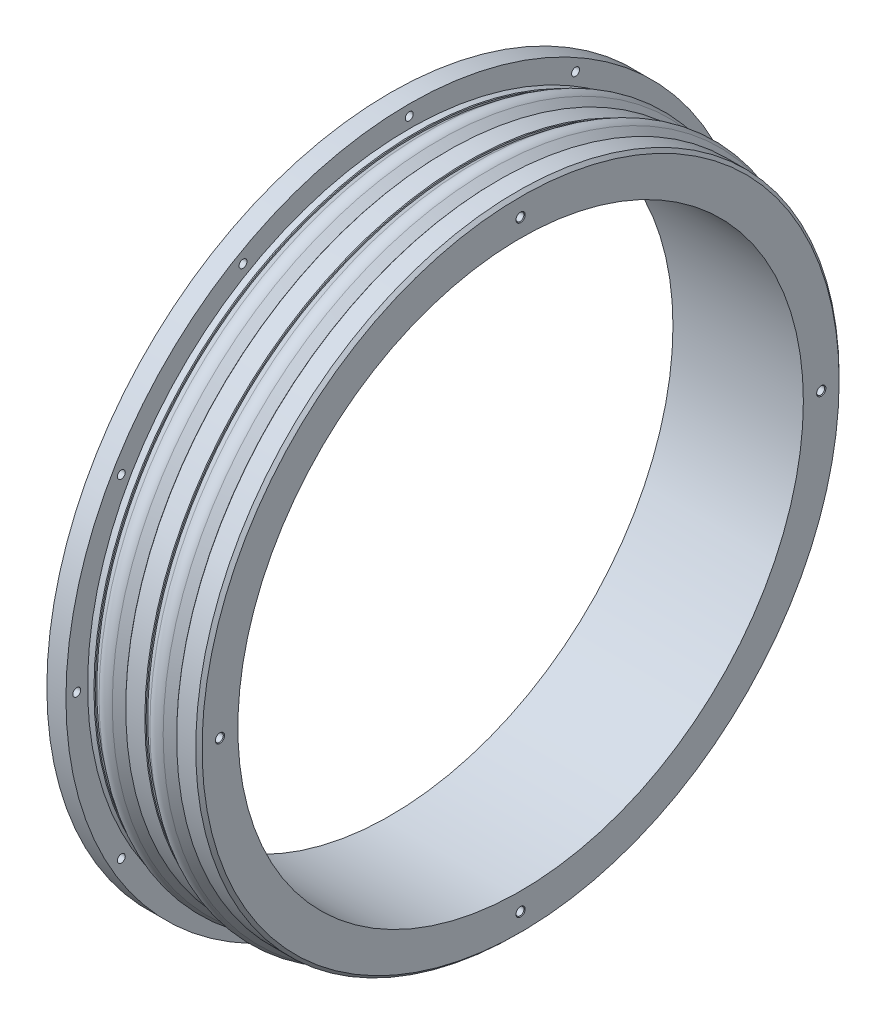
ISO-10303-21;
HEADER;
FILE_DESCRIPTION(('STEP AP214'),'2;1');
FILE_NAME('part.step','',(''),(''),'','','');
FILE_SCHEMA(('AUTOMOTIVE_DESIGN { 1 0 10303 214 1 1 1 1 }'));
ENDSEC;
DATA;
#1=APPLICATION_CONTEXT('core data for automotive mechanical design processes');
#2=APPLICATION_PROTOCOL_DEFINITION('international standard','automotive_design',2000,#1);
#3=PRODUCT_CONTEXT('',#1,'mechanical');
#4=PRODUCT('Part','Part','',(#3));
#5=PRODUCT_RELATED_PRODUCT_CATEGORY('part','',(#4));
#6=PRODUCT_DEFINITION_FORMATION('','',#4);
#7=PRODUCT_DEFINITION_CONTEXT('part definition',#1,'design');
#8=PRODUCT_DEFINITION('design','',#6,#7);
#9=PRODUCT_DEFINITION_SHAPE('','',#8);
#10=(LENGTH_UNIT() NAMED_UNIT(*) SI_UNIT(.MILLI.,.METRE.));
#11=(NAMED_UNIT(*) PLANE_ANGLE_UNIT() SI_UNIT($,.RADIAN.));
#12=(NAMED_UNIT(*) SI_UNIT($,.STERADIAN.) SOLID_ANGLE_UNIT());
#13=UNCERTAINTY_MEASURE_WITH_UNIT(LENGTH_MEASURE(1.E-05),#10,'distance_accuracy_value','');
#14=(GEOMETRIC_REPRESENTATION_CONTEXT(3) GLOBAL_UNCERTAINTY_ASSIGNED_CONTEXT((#13)) GLOBAL_UNIT_ASSIGNED_CONTEXT((#10,
#11,#12)) REPRESENTATION_CONTEXT('',''));
#15=CARTESIAN_POINT('',(0.,0.,0.));
#16=DIRECTION('',(0.,0.,1.));
#17=DIRECTION('',(1.,0.,0.));
#18=AXIS2_PLACEMENT_3D('',#15,#16,#17);
#19=CARTESIAN_POINT('',(29.,0.,0.));
#20=DIRECTION('',(1.,0.,0.));
#21=DIRECTION('',(0.,0.,-1.));
#22=AXIS2_PLACEMENT_3D('',#19,#20,#21);
#23=TOROIDAL_SURFACE('',#22,99.65,3.5);
#24=CARTESIAN_POINT('',(31.0833480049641,0.,0.));
#25=DIRECTION('',(1.,0.,0.));
#26=DIRECTION('',(0.,0.,-1.));
#27=AXIS2_PLACEMENT_3D('',#24,#25,#26);
#28=CIRCLE('',#27,102.462411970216);
#29=CARTESIAN_POINT('',(31.0833480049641,0.,-102.462411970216));
#30=VERTEX_POINT('',#29);
#31=EDGE_CURVE('E113',#30,#30,#28,.T.);
#32=ORIENTED_EDGE('',*,*,#31,.F.);
#33=EDGE_LOOP('',(#32));
#34=FACE_BOUND('',#33,.T.);
#35=CARTESIAN_POINT('',(26.9166519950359,0.,0.));
#36=DIRECTION('',(1.,0.,0.));
#37=DIRECTION('',(0.,0.,-1.));
#38=AXIS2_PLACEMENT_3D('',#35,#36,#37);
#39=CIRCLE('',#38,102.462411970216);
#40=CARTESIAN_POINT('',(26.9166519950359,0.,-102.462411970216));
#41=VERTEX_POINT('',#40);
#42=EDGE_CURVE('E161',#41,#41,#39,.T.);
#43=ORIENTED_EDGE('',*,*,#42,.T.);
#44=EDGE_LOOP('',(#43));
#45=FACE_BOUND('',#44,.T.);
#46=ADVANCED_FACE('F35',(#34,#45),#23,.T.);
#47=CARTESIAN_POINT('',(24.2,0.,0.));
#48=DIRECTION('',(1.,0.,0.));
#49=DIRECTION('',(0.,0.,-1.));
#50=AXIS2_PLACEMENT_3D('',#47,#48,#49);
#51=CONICAL_SURFACE('',#50,100.45,0.637567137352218);
#52=ORIENTED_EDGE('',*,*,#42,.F.);
#53=EDGE_LOOP('',(#52));
#54=FACE_BOUND('',#53,.T.);
#55=CARTESIAN_POINT('',(24.2,0.,0.));
#56=DIRECTION('',(1.,0.,0.));
#57=DIRECTION('',(0.,0.,-1.));
#58=AXIS2_PLACEMENT_3D('',#55,#56,#57);
#59=CIRCLE('',#58,100.45);
#60=CARTESIAN_POINT('',(24.2,0.,-100.45));
#61=VERTEX_POINT('',#60);
#62=EDGE_CURVE('E158',#61,#61,#59,.T.);
#63=ORIENTED_EDGE('',*,*,#62,.T.);
#64=EDGE_LOOP('',(#63));
#65=FACE_BOUND('',#64,.T.);
#66=ADVANCED_FACE('F315',(#54,#65),#51,.T.);
#67=CARTESIAN_POINT('',(24.2,0.,0.));
#68=DIRECTION('',(-1.,0.,0.));
#69=DIRECTION('',(0.,0.,1.));
#70=AXIS2_PLACEMENT_3D('',#67,#68,#69);
#71=PLANE('',#70);
#72=CARTESIAN_POINT('',(24.2,0.,0.));
#73=DIRECTION('',(-1.,0.,0.));
#74=DIRECTION('',(0.,0.,1.));
#75=AXIS2_PLACEMENT_3D('',#72,#73,#74);
#76=CIRCLE('',#75,100.95);
#77=CARTESIAN_POINT('',(24.2,0.,100.95));
#78=VERTEX_POINT('',#77);
#79=EDGE_CURVE('E176',#78,#78,#76,.F.);
#80=ORIENTED_EDGE('',*,*,#79,.T.);
#81=EDGE_LOOP('',(#80));
#82=FACE_BOUND('',#81,.T.);
#83=ORIENTED_EDGE('',*,*,#62,.F.);
#84=EDGE_LOOP('',(#83));
#85=FACE_BOUND('',#84,.T.);
#86=ADVANCED_FACE('F321',(#82,#85),#71,.F.);
#87=CARTESIAN_POINT('',(0.,0.,0.));
#88=DIRECTION('',(1.,0.,0.));
#89=DIRECTION('',(0.,0.,-1.));
#90=AXIS2_PLACEMENT_3D('',#87,#88,#89);
#91=CYLINDRICAL_SURFACE('',#90,101.15);
#92=CARTESIAN_POINT('',(24.0000000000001,0.,0.));
#93=DIRECTION('',(-1.,0.,0.));
#94=DIRECTION('',(0.,0.,1.));
#95=AXIS2_PLACEMENT_3D('',#92,#93,#94);
#96=CIRCLE('',#95,101.15);
#97=CARTESIAN_POINT('',(24.0000000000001,0.,101.15));
#98=VERTEX_POINT('',#97);
#99=EDGE_CURVE('E182',#98,#98,#96,.T.);
#100=ORIENTED_EDGE('',*,*,#99,.T.);
#101=EDGE_LOOP('',(#100));
#102=FACE_BOUND('',#101,.T.);
#103=CARTESIAN_POINT('',(18.,0.,0.));
#104=DIRECTION('',(1.,0.,0.));
#105=DIRECTION('',(0.,0.,-1.));
#106=AXIS2_PLACEMENT_3D('',#103,#104,#105);
#107=CIRCLE('',#106,101.15);
#108=CARTESIAN_POINT('',(18.,0.,-101.15));
#109=VERTEX_POINT('',#108);
#110=EDGE_CURVE('E179',#109,#109,#107,.T.);
#111=ORIENTED_EDGE('',*,*,#110,.T.);
#112=EDGE_LOOP('',(#111));
#113=FACE_BOUND('',#112,.T.);
#114=ADVANCED_FACE('F480',(#102,#113),#91,.T.);
#115=CARTESIAN_POINT('',(17.8,0.,0.));
#116=DIRECTION('',(1.,0.,0.));
#117=DIRECTION('',(0.,0.,-1.));
#118=AXIS2_PLACEMENT_3D('',#115,#116,#117);
#119=PLANE('',#118);
#120=CARTESIAN_POINT('',(17.8,0.,0.));
#121=DIRECTION('',(1.,0.,0.));
#122=DIRECTION('',(0.,0.,-1.));
#123=AXIS2_PLACEMENT_3D('',#120,#121,#122);
#124=CIRCLE('',#123,100.95);
#125=CARTESIAN_POINT('',(17.8,0.,-100.95));
#126=VERTEX_POINT('',#125);
#127=EDGE_CURVE('E185',#126,#126,#124,.F.);
#128=ORIENTED_EDGE('',*,*,#127,.T.);
#129=EDGE_LOOP('',(#128));
#130=FACE_BOUND('',#129,.T.);
#131=CARTESIAN_POINT('',(17.8,0.,0.));
#132=DIRECTION('',(1.,0.,0.));
#133=DIRECTION('',(0.,0.,-1.));
#134=AXIS2_PLACEMENT_3D('',#131,#132,#133);
#135=CIRCLE('',#134,100.45);
#136=CARTESIAN_POINT('',(17.8,0.,-100.45));
#137=VERTEX_POINT('',#136);
#138=EDGE_CURVE('E155',#137,#137,#135,.T.);
#139=ORIENTED_EDGE('',*,*,#138,.T.);
#140=EDGE_LOOP('',(#139));
#141=FACE_BOUND('',#140,.T.);
#142=ADVANCED_FACE('F476',(#130,#141),#119,.F.);
#143=CARTESIAN_POINT('',(15.0833480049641,0.,0.));
#144=DIRECTION('',(-1.,0.,0.));
#145=DIRECTION('',(0.,0.,1.));
#146=AXIS2_PLACEMENT_3D('',#143,#144,#145);
#147=CONICAL_SURFACE('',#146,102.462411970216,0.637567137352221);
#148=ORIENTED_EDGE('',*,*,#138,.F.);
#149=EDGE_LOOP('',(#148));
#150=FACE_BOUND('',#149,.T.);
#151=CARTESIAN_POINT('',(15.0833480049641,0.,0.));
#152=DIRECTION('',(1.,0.,0.));
#153=DIRECTION('',(0.,0.,-1.));
#154=AXIS2_PLACEMENT_3D('',#151,#152,#153);
#155=CIRCLE('',#154,102.462411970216);
#156=CARTESIAN_POINT('',(15.0833480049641,0.,-102.462411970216));
#157=VERTEX_POINT('',#156);
#158=EDGE_CURVE('E152',#157,#157,#155,.T.);
#159=ORIENTED_EDGE('',*,*,#158,.T.);
#160=EDGE_LOOP('',(#159));
#161=FACE_BOUND('',#160,.T.);
#162=ADVANCED_FACE('F472',(#150,#161),#147,.T.);
#163=CARTESIAN_POINT('',(13.,0.,0.));
#164=DIRECTION('',(1.,0.,0.));
#165=DIRECTION('',(0.,0.,-1.));
#166=AXIS2_PLACEMENT_3D('',#163,#164,#165);
#167=TOROIDAL_SURFACE('',#166,99.65,3.50000000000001);
#168=ORIENTED_EDGE('',*,*,#158,.F.);
#169=EDGE_LOOP('',(#168));
#170=FACE_BOUND('',#169,.T.);
#171=CARTESIAN_POINT('',(10.9166519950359,0.,0.));
#172=DIRECTION('',(1.,0.,0.));
#173=DIRECTION('',(0.,0.,-1.));
#174=AXIS2_PLACEMENT_3D('',#171,#172,#173);
#175=CIRCLE('',#174,102.462411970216);
#176=CARTESIAN_POINT('',(10.9166519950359,0.,-102.462411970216));
#177=VERTEX_POINT('',#176);
#178=EDGE_CURVE('E149',#177,#177,#175,.T.);
#179=ORIENTED_EDGE('',*,*,#178,.T.);
#180=EDGE_LOOP('',(#179));
#181=FACE_BOUND('',#180,.T.);
#182=ADVANCED_FACE('F468',(#170,#181),#167,.T.);
#183=CARTESIAN_POINT('',(8.20000000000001,0.,0.));
#184=DIRECTION('',(1.,0.,0.));
#185=DIRECTION('',(0.,0.,-1.));
#186=AXIS2_PLACEMENT_3D('',#183,#184,#185);
#187=CONICAL_SURFACE('',#186,100.45,0.637567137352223);
#188=ORIENTED_EDGE('',*,*,#178,.F.);
#189=EDGE_LOOP('',(#188));
#190=FACE_BOUND('',#189,.T.);
#191=CARTESIAN_POINT('',(8.20000000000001,0.,0.));
#192=DIRECTION('',(1.,0.,0.));
#193=DIRECTION('',(0.,0.,-1.));
#194=AXIS2_PLACEMENT_3D('',#191,#192,#193);
#195=CIRCLE('',#194,100.45);
#196=CARTESIAN_POINT('',(8.20000000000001,0.,-100.45));
#197=VERTEX_POINT('',#196);
#198=EDGE_CURVE('E146',#197,#197,#195,.T.);
#199=ORIENTED_EDGE('',*,*,#198,.T.);
#200=EDGE_LOOP('',(#199));
#201=FACE_BOUND('',#200,.T.);
#202=ADVANCED_FACE('F461',(#190,#201),#187,.T.);
#203=CARTESIAN_POINT('',(8.20000000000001,0.,0.));
#204=DIRECTION('',(-1.,0.,0.));
#205=DIRECTION('',(0.,0.,1.));
#206=AXIS2_PLACEMENT_3D('',#203,#204,#205);
#207=PLANE('',#206);
#208=CARTESIAN_POINT('',(8.20000000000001,0.,0.));
#209=DIRECTION('',(-1.,0.,0.));
#210=DIRECTION('',(0.,0.,1.));
#211=AXIS2_PLACEMENT_3D('',#208,#209,#210);
#212=CIRCLE('',#211,100.95);
#213=CARTESIAN_POINT('',(8.20000000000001,0.,100.95));
#214=VERTEX_POINT('',#213);
#215=EDGE_CURVE('E188',#214,#214,#212,.F.);
#216=ORIENTED_EDGE('',*,*,#215,.T.);
#217=EDGE_LOOP('',(#216));
#218=FACE_BOUND('',#217,.T.);
#219=ORIENTED_EDGE('',*,*,#198,.F.);
#220=EDGE_LOOP('',(#219));
#221=FACE_BOUND('',#220,.T.);
#222=ADVANCED_FACE('F455',(#218,#221),#207,.F.);
#223=CARTESIAN_POINT('',(0.,0.,0.));
#224=DIRECTION('',(1.,0.,0.));
#225=DIRECTION('',(0.,0.,-1.));
#226=AXIS2_PLACEMENT_3D('',#223,#224,#225);
#227=CYLINDRICAL_SURFACE('',#226,101.15);
#228=CARTESIAN_POINT('',(8.00000000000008,0.,0.));
#229=DIRECTION('',(-1.,0.,0.));
#230=DIRECTION('',(0.,0.,1.));
#231=AXIS2_PLACEMENT_3D('',#228,#229,#230);
#232=CIRCLE('',#231,101.15);
#233=CARTESIAN_POINT('',(8.00000000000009,0.,101.15));
#234=VERTEX_POINT('',#233);
#235=EDGE_CURVE('E191',#234,#234,#232,.T.);
#236=ORIENTED_EDGE('',*,*,#235,.T.);
#237=EDGE_LOOP('',(#236));
#238=FACE_BOUND('',#237,.T.);
#239=CARTESIAN_POINT('',(6.,0.,0.));
#240=DIRECTION('',(1.,0.,0.));
#241=DIRECTION('',(0.,0.,-1.));
#242=AXIS2_PLACEMENT_3D('',#239,#240,#241);
#243=CIRCLE('',#242,101.15);
#244=CARTESIAN_POINT('',(6.,0.,-101.15));
#245=VERTEX_POINT('',#244);
#246=EDGE_CURVE('E143',#245,#245,#243,.T.);
#247=ORIENTED_EDGE('',*,*,#246,.T.);
#248=EDGE_LOOP('',(#247));
#249=FACE_BOUND('',#248,.T.);
#250=ADVANCED_FACE('F426',(#238,#249),#227,.T.);
#251=CARTESIAN_POINT('',(6.,0.,0.));
#252=DIRECTION('',(1.,0.,0.));
#253=DIRECTION('',(0.,0.,-1.));
#254=AXIS2_PLACEMENT_3D('',#251,#252,#253);
#255=PLANE('',#254);
#256=CARTESIAN_POINT('',(6.,104.55,0.));
#257=DIRECTION('',(1.,0.,0.));
#258=DIRECTION('',(0.,0.,-1.));
#259=AXIS2_PLACEMENT_3D('',#256,#257,#258);
#260=CIRCLE('',#259,1.24999999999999);
#261=CARTESIAN_POINT('',(6.,104.55,-1.24999999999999));
#262=VERTEX_POINT('',#261);
#263=EDGE_CURVE('E77',#262,#262,#260,.T.);
#264=ORIENTED_EDGE('',*,*,#263,.F.);
#265=EDGE_LOOP('',(#264));
#266=FACE_BOUND('',#265,.T.);
#267=CARTESIAN_POINT('',(6.,90.542955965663,-52.2750000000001));
#268=DIRECTION('',(1.,0.,0.));
#269=DIRECTION('',(0.,0.,-1.));
#270=AXIS2_PLACEMENT_3D('',#267,#268,#269);
#271=CIRCLE('',#270,1.24999999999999);
#272=CARTESIAN_POINT('',(6.,90.542955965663,-53.5250000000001));
#273=VERTEX_POINT('',#272);
#274=EDGE_CURVE('E80',#273,#273,#271,.T.);
#275=ORIENTED_EDGE('',*,*,#274,.F.);
#276=EDGE_LOOP('',(#275));
#277=FACE_BOUND('',#276,.T.);
#278=CARTESIAN_POINT('',(6.,52.275,-90.5429559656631));
#279=DIRECTION('',(1.,0.,0.));
#280=DIRECTION('',(0.,0.,-1.));
#281=AXIS2_PLACEMENT_3D('',#278,#279,#280);
#282=CIRCLE('',#281,1.24999999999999);
#283=CARTESIAN_POINT('',(6.,52.275,-91.792955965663));
#284=VERTEX_POINT('',#283);
#285=EDGE_CURVE('E83',#284,#284,#282,.T.);
#286=ORIENTED_EDGE('',*,*,#285,.F.);
#287=EDGE_LOOP('',(#286));
#288=FACE_BOUND('',#287,.T.);
#289=CARTESIAN_POINT('',(6.,0.,-104.55));
#290=DIRECTION('',(1.,0.,0.));
#291=DIRECTION('',(0.,0.,-1.));
#292=AXIS2_PLACEMENT_3D('',#289,#290,#291);
#293=CIRCLE('',#292,1.24999999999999);
#294=CARTESIAN_POINT('',(6.,0.,-105.8));
#295=VERTEX_POINT('',#294);
#296=EDGE_CURVE('E86',#295,#295,#293,.T.);
#297=ORIENTED_EDGE('',*,*,#296,.F.);
#298=EDGE_LOOP('',(#297));
#299=FACE_BOUND('',#298,.T.);
#300=CARTESIAN_POINT('',(6.,-52.275,-90.5429559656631));
#301=DIRECTION('',(1.,0.,0.));
#302=DIRECTION('',(0.,0.,-1.));
#303=AXIS2_PLACEMENT_3D('',#300,#301,#302);
#304=CIRCLE('',#303,1.24999999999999);
#305=CARTESIAN_POINT('',(6.,-52.275,-91.7929559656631));
#306=VERTEX_POINT('',#305);
#307=EDGE_CURVE('E89',#306,#306,#304,.T.);
#308=ORIENTED_EDGE('',*,*,#307,.F.);
#309=EDGE_LOOP('',(#308));
#310=FACE_BOUND('',#309,.T.);
#311=CARTESIAN_POINT('',(6.,-90.542955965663,-52.275));
#312=DIRECTION('',(1.,0.,0.));
#313=DIRECTION('',(0.,0.,-1.));
#314=AXIS2_PLACEMENT_3D('',#311,#312,#313);
#315=CIRCLE('',#314,1.24999999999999);
#316=CARTESIAN_POINT('',(6.,-90.542955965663,-53.525));
#317=VERTEX_POINT('',#316);
#318=EDGE_CURVE('E92',#317,#317,#315,.T.);
#319=ORIENTED_EDGE('',*,*,#318,.F.);
#320=EDGE_LOOP('',(#319));
#321=FACE_BOUND('',#320,.T.);
#322=CARTESIAN_POINT('',(6.,-104.55,0.));
#323=DIRECTION('',(1.,0.,0.));
#324=DIRECTION('',(0.,0.,-1.));
#325=AXIS2_PLACEMENT_3D('',#322,#323,#324);
#326=CIRCLE('',#325,1.24999999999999);
#327=CARTESIAN_POINT('',(6.,-104.55,-1.24999999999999));
#328=VERTEX_POINT('',#327);
#329=EDGE_CURVE('E95',#328,#328,#326,.T.);
#330=ORIENTED_EDGE('',*,*,#329,.F.);
#331=EDGE_LOOP('',(#330));
#332=FACE_BOUND('',#331,.T.);
#333=CARTESIAN_POINT('',(6.,-90.5429559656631,52.275));
#334=DIRECTION('',(1.,0.,0.));
#335=DIRECTION('',(0.,0.,-1.));
#336=AXIS2_PLACEMENT_3D('',#333,#334,#335);
#337=CIRCLE('',#336,1.24999999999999);
#338=CARTESIAN_POINT('',(6.,-90.5429559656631,51.025));
#339=VERTEX_POINT('',#338);
#340=EDGE_CURVE('E98',#339,#339,#337,.T.);
#341=ORIENTED_EDGE('',*,*,#340,.F.);
#342=EDGE_LOOP('',(#341));
#343=FACE_BOUND('',#342,.T.);
#344=CARTESIAN_POINT('',(6.,-52.275,90.542955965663));
#345=DIRECTION('',(1.,0.,0.));
#346=DIRECTION('',(0.,0.,-1.));
#347=AXIS2_PLACEMENT_3D('',#344,#345,#346);
#348=CIRCLE('',#347,1.24999999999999);
#349=CARTESIAN_POINT('',(6.,-52.275,89.2929559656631));
#350=VERTEX_POINT('',#349);
#351=EDGE_CURVE('E101',#350,#350,#348,.T.);
#352=ORIENTED_EDGE('',*,*,#351,.F.);
#353=EDGE_LOOP('',(#352));
#354=FACE_BOUND('',#353,.T.);
#355=CARTESIAN_POINT('',(6.,0.,104.55));
#356=DIRECTION('',(1.,0.,0.));
#357=DIRECTION('',(0.,0.,-1.));
#358=AXIS2_PLACEMENT_3D('',#355,#356,#357);
#359=CIRCLE('',#358,1.24999999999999);
#360=CARTESIAN_POINT('',(6.,0.,103.3));
#361=VERTEX_POINT('',#360);
#362=EDGE_CURVE('E104',#361,#361,#359,.T.);
#363=ORIENTED_EDGE('',*,*,#362,.F.);
#364=EDGE_LOOP('',(#363));
#365=FACE_BOUND('',#364,.T.);
#366=CARTESIAN_POINT('',(6.,52.2749999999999,90.5429559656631));
#367=DIRECTION('',(1.,0.,0.));
#368=DIRECTION('',(0.,0.,-1.));
#369=AXIS2_PLACEMENT_3D('',#366,#367,#368);
#370=CIRCLE('',#369,1.24999999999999);
#371=CARTESIAN_POINT('',(6.,52.2749999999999,89.2929559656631));
#372=VERTEX_POINT('',#371);
#373=EDGE_CURVE('E107',#372,#372,#370,.T.);
#374=ORIENTED_EDGE('',*,*,#373,.F.);
#375=EDGE_LOOP('',(#374));
#376=FACE_BOUND('',#375,.T.);
#377=CARTESIAN_POINT('',(6.,90.5429559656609,52.2749999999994));
#378=DIRECTION('',(1.,0.,0.));
#379=DIRECTION('',(0.,0.,-1.));
#380=AXIS2_PLACEMENT_3D('',#377,#378,#379);
#381=CIRCLE('',#380,1.24999999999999);
#382=CARTESIAN_POINT('',(6.,90.5429559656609,51.0249999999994));
#383=VERTEX_POINT('',#382);
#384=EDGE_CURVE('E110',#383,#383,#381,.T.);
#385=ORIENTED_EDGE('',*,*,#384,.F.);
#386=EDGE_LOOP('',(#385));
#387=FACE_BOUND('',#386,.T.);
#388=CARTESIAN_POINT('',(6.,0.,0.));
#389=DIRECTION('',(1.,0.,0.));
#390=DIRECTION('',(0.,0.,-1.));
#391=AXIS2_PLACEMENT_3D('',#388,#389,#390);
#392=CIRCLE('',#391,107.95);
#393=CARTESIAN_POINT('',(6.,0.,-107.95));
#394=VERTEX_POINT('',#393);
#395=EDGE_CURVE('E140',#394,#394,#392,.T.);
#396=ORIENTED_EDGE('',*,*,#395,.T.);
#397=EDGE_LOOP('',(#396));
#398=FACE_BOUND('',#397,.T.);
#399=ORIENTED_EDGE('',*,*,#246,.F.);
#400=EDGE_LOOP('',(#399));
#401=FACE_BOUND('',#400,.T.);
#402=ADVANCED_FACE('F422',(#266,#277,#288,#299,#310,#321,#332,#343,#354,#365,#376,#387,#398,
#401),#255,.T.);
#403=CARTESIAN_POINT('',(0.,0.,0.));
#404=DIRECTION('',(1.,0.,0.));
#405=DIRECTION('',(0.,0.,-1.));
#406=AXIS2_PLACEMENT_3D('',#403,#404,#405);
#407=CYLINDRICAL_SURFACE('',#406,107.95);
#408=CARTESIAN_POINT('',(0.,0.,0.));
#409=DIRECTION('',(1.,0.,0.));
#410=DIRECTION('',(0.,0.,-1.));
#411=AXIS2_PLACEMENT_3D('',#408,#409,#410);
#412=CIRCLE('',#411,107.95);
#413=CARTESIAN_POINT('',(0.,0.,-107.95));
#414=VERTEX_POINT('',#413);
#415=EDGE_CURVE('E137',#414,#414,#412,.T.);
#416=ORIENTED_EDGE('',*,*,#415,.T.);
#417=EDGE_LOOP('',(#416));
#418=FACE_BOUND('',#417,.T.);
#419=ORIENTED_EDGE('',*,*,#395,.F.);
#420=EDGE_LOOP('',(#419));
#421=FACE_BOUND('',#420,.T.);
#422=ADVANCED_FACE('F425',(#418,#421),#407,.T.);
#423=CARTESIAN_POINT('',(0.,0.,0.));
#424=DIRECTION('',(-1.,0.,0.));
#425=DIRECTION('',(0.,0.,1.));
#426=AXIS2_PLACEMENT_3D('',#423,#424,#425);
#427=PLANE('',#426);
#428=CARTESIAN_POINT('',(0.,-52.275,-90.5429559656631));
#429=DIRECTION('',(-1.,0.,0.));
#430=DIRECTION('',(0.,0.,1.));
#431=AXIS2_PLACEMENT_3D('',#428,#429,#430);
#432=CIRCLE('',#431,1.44999999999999);
#433=CARTESIAN_POINT('',(0.,-52.275,-89.0929559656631));
#434=VERTEX_POINT('',#433);
#435=EDGE_CURVE('E266',#434,#434,#432,.F.);
#436=ORIENTED_EDGE('',*,*,#435,.T.);
#437=EDGE_LOOP('',(#436));
#438=FACE_BOUND('',#437,.T.);
#439=CARTESIAN_POINT('',(0.,-90.542955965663,-52.275));
#440=DIRECTION('',(-1.,0.,0.));
#441=DIRECTION('',(0.,0.,1.));
#442=AXIS2_PLACEMENT_3D('',#439,#440,#441);
#443=CIRCLE('',#442,1.45);
#444=CARTESIAN_POINT('',(0.,-90.542955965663,-50.825));
#445=VERTEX_POINT('',#444);
#446=EDGE_CURVE('E263',#445,#445,#443,.F.);
#447=ORIENTED_EDGE('',*,*,#446,.T.);
#448=EDGE_LOOP('',(#447));
#449=FACE_BOUND('',#448,.T.);
#450=CARTESIAN_POINT('',(0.,-104.55,0.));
#451=DIRECTION('',(-1.,0.,0.));
#452=DIRECTION('',(0.,0.,1.));
#453=AXIS2_PLACEMENT_3D('',#450,#451,#452);
#454=CIRCLE('',#453,1.45);
#455=CARTESIAN_POINT('',(0.,-104.55,1.45));
#456=VERTEX_POINT('',#455);
#457=EDGE_CURVE('E260',#456,#456,#454,.F.);
#458=ORIENTED_EDGE('',*,*,#457,.T.);
#459=EDGE_LOOP('',(#458));
#460=FACE_BOUND('',#459,.T.);
#461=CARTESIAN_POINT('',(0.,-90.5429559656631,52.275));
#462=DIRECTION('',(-1.,0.,0.));
#463=DIRECTION('',(0.,0.,1.));
#464=AXIS2_PLACEMENT_3D('',#461,#462,#463);
#465=CIRCLE('',#464,1.45);
#466=CARTESIAN_POINT('',(0.,-90.5429559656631,53.725));
#467=VERTEX_POINT('',#466);
#468=EDGE_CURVE('E257',#467,#467,#465,.F.);
#469=ORIENTED_EDGE('',*,*,#468,.T.);
#470=EDGE_LOOP('',(#469));
#471=FACE_BOUND('',#470,.T.);
#472=CARTESIAN_POINT('',(0.,-52.275,90.542955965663));
#473=DIRECTION('',(-1.,0.,0.));
#474=DIRECTION('',(0.,0.,1.));
#475=AXIS2_PLACEMENT_3D('',#472,#473,#474);
#476=CIRCLE('',#475,1.44999999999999);
#477=CARTESIAN_POINT('',(0.,-52.275,91.992955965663));
#478=VERTEX_POINT('',#477);
#479=EDGE_CURVE('E254',#478,#478,#476,.F.);
#480=ORIENTED_EDGE('',*,*,#479,.T.);
#481=EDGE_LOOP('',(#480));
#482=FACE_BOUND('',#481,.T.);
#483=CARTESIAN_POINT('',(0.,0.,104.55));
#484=DIRECTION('',(-1.,0.,0.));
#485=DIRECTION('',(0.,0.,1.));
#486=AXIS2_PLACEMENT_3D('',#483,#484,#485);
#487=CIRCLE('',#486,1.44999999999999);
#488=CARTESIAN_POINT('',(0.,0.,106.));
#489=VERTEX_POINT('',#488);
#490=EDGE_CURVE('E251',#489,#489,#487,.F.);
#491=ORIENTED_EDGE('',*,*,#490,.T.);
#492=EDGE_LOOP('',(#491));
#493=FACE_BOUND('',#492,.T.);
#494=CARTESIAN_POINT('',(0.,52.2749999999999,90.5429559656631));
#495=DIRECTION('',(-1.,0.,0.));
#496=DIRECTION('',(0.,0.,1.));
#497=AXIS2_PLACEMENT_3D('',#494,#495,#496);
#498=CIRCLE('',#497,1.44999999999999);
#499=CARTESIAN_POINT('',(0.,52.2749999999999,91.9929559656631));
#500=VERTEX_POINT('',#499);
#501=EDGE_CURVE('E248',#500,#500,#498,.F.);
#502=ORIENTED_EDGE('',*,*,#501,.T.);
#503=EDGE_LOOP('',(#502));
#504=FACE_BOUND('',#503,.T.);
#505=CARTESIAN_POINT('',(0.,90.5429559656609,52.2749999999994));
#506=DIRECTION('',(-1.,0.,0.));
#507=DIRECTION('',(0.,0.,1.));
#508=AXIS2_PLACEMENT_3D('',#505,#506,#507);
#509=CIRCLE('',#508,1.45);
#510=CARTESIAN_POINT('',(0.,90.5429559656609,53.7249999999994));
#511=VERTEX_POINT('',#510);
#512=EDGE_CURVE('E245',#511,#511,#509,.F.);
#513=ORIENTED_EDGE('',*,*,#512,.T.);
#514=EDGE_LOOP('',(#513));
#515=FACE_BOUND('',#514,.T.);
#516=CARTESIAN_POINT('',(0.,104.55,0.));
#517=DIRECTION('',(-1.,0.,0.));
#518=DIRECTION('',(0.,0.,1.));
#519=AXIS2_PLACEMENT_3D('',#516,#517,#518);
#520=CIRCLE('',#519,1.45);
#521=CARTESIAN_POINT('',(0.,104.55,1.45));
#522=VERTEX_POINT('',#521);
#523=EDGE_CURVE('E242',#522,#522,#520,.F.);
#524=ORIENTED_EDGE('',*,*,#523,.T.);
#525=EDGE_LOOP('',(#524));
#526=FACE_BOUND('',#525,.T.);
#527=CARTESIAN_POINT('',(0.,90.542955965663,-52.2750000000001));
#528=DIRECTION('',(-1.,0.,0.));
#529=DIRECTION('',(0.,0.,1.));
#530=AXIS2_PLACEMENT_3D('',#527,#528,#529);
#531=CIRCLE('',#530,1.45);
#532=CARTESIAN_POINT('',(0.,90.542955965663,-50.8250000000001));
#533=VERTEX_POINT('',#532);
#534=EDGE_CURVE('E239',#533,#533,#531,.F.);
#535=ORIENTED_EDGE('',*,*,#534,.T.);
#536=EDGE_LOOP('',(#535));
#537=FACE_BOUND('',#536,.T.);
#538=CARTESIAN_POINT('',(0.,52.275,-90.5429559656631));
#539=DIRECTION('',(-1.,0.,0.));
#540=DIRECTION('',(0.,0.,1.));
#541=AXIS2_PLACEMENT_3D('',#538,#539,#540);
#542=CIRCLE('',#541,1.44999999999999);
#543=CARTESIAN_POINT('',(0.,52.275,-89.0929559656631));
#544=VERTEX_POINT('',#543);
#545=EDGE_CURVE('E236',#544,#544,#542,.F.);
#546=ORIENTED_EDGE('',*,*,#545,.T.);
#547=EDGE_LOOP('',(#546));
#548=FACE_BOUND('',#547,.T.);
#549=CARTESIAN_POINT('',(0.,0.,-104.55));
#550=DIRECTION('',(-1.,0.,0.));
#551=DIRECTION('',(0.,0.,1.));
#552=AXIS2_PLACEMENT_3D('',#549,#550,#551);
#553=CIRCLE('',#552,1.44999999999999);
#554=CARTESIAN_POINT('',(0.,0.,-103.1));
#555=VERTEX_POINT('',#554);
#556=EDGE_CURVE('E233',#555,#555,#553,.F.);
#557=ORIENTED_EDGE('',*,*,#556,.T.);
#558=EDGE_LOOP('',(#557));
#559=FACE_BOUND('',#558,.T.);
#560=CARTESIAN_POINT('',(0.,0.,0.));
#561=DIRECTION('',(-1.,0.,0.));
#562=DIRECTION('',(0.,0.,1.));
#563=AXIS2_PLACEMENT_3D('',#560,#561,#562);
#564=CIRCLE('',#563,101.47);
#565=CARTESIAN_POINT('',(0.,0.,101.47));
#566=VERTEX_POINT('',#565);
#567=EDGE_CURVE('E200',#566,#566,#564,.F.);
#568=ORIENTED_EDGE('',*,*,#567,.T.);
#569=EDGE_LOOP('',(#568));
#570=FACE_BOUND('',#569,.T.);
#571=ORIENTED_EDGE('',*,*,#415,.F.);
#572=EDGE_LOOP('',(#571));
#573=FACE_BOUND('',#572,.T.);
#574=ADVANCED_FACE('F537',(#438,#449,#460,#471,#482,#493,#504,#515,#526,#537,#548,#559,#570,
#573),#427,.T.);
#575=CARTESIAN_POINT('',(0.,0.,0.));
#576=DIRECTION('',(1.,0.,0.));
#577=DIRECTION('',(0.,0.,-1.));
#578=AXIS2_PLACEMENT_3D('',#575,#576,#577);
#579=CYLINDRICAL_SURFACE('',#578,101.27);
#580=CARTESIAN_POINT('',(0.200000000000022,0.,0.));
#581=DIRECTION('',(-1.,0.,0.));
#582=DIRECTION('',(0.,0.,1.));
#583=AXIS2_PLACEMENT_3D('',#580,#581,#582);
#584=CIRCLE('',#583,101.27);
#585=CARTESIAN_POINT('',(0.200000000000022,0.,101.27));
#586=VERTEX_POINT('',#585);
#587=EDGE_CURVE('E203',#586,#586,#584,.T.);
#588=ORIENTED_EDGE('',*,*,#587,.T.);
#589=EDGE_LOOP('',(#588));
#590=FACE_BOUND('',#589,.T.);
#591=CARTESIAN_POINT('',(0.750000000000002,0.,0.));
#592=DIRECTION('',(1.,0.,0.));
#593=DIRECTION('',(0.,0.,-1.));
#594=AXIS2_PLACEMENT_3D('',#591,#592,#593);
#595=CIRCLE('',#594,101.27);
#596=CARTESIAN_POINT('',(0.750000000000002,0.,-101.27));
#597=VERTEX_POINT('',#596);
#598=EDGE_CURVE('E134',#597,#597,#595,.T.);
#599=ORIENTED_EDGE('',*,*,#598,.T.);
#600=EDGE_LOOP('',(#599));
#601=FACE_BOUND('',#600,.T.);
#602=ADVANCED_FACE('F531',(#590,#601),#579,.F.);
#603=CARTESIAN_POINT('',(0.0113187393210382,0.,0.));
#604=DIRECTION('',(1.,0.,0.));
#605=DIRECTION('',(0.,0.,-1.));
#606=AXIS2_PLACEMENT_3D('',#603,#604,#605);
#607=CONICAL_SURFACE('',#606,100.728889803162,0.63222977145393);
#608=ORIENTED_EDGE('',*,*,#598,.F.);
#609=EDGE_LOOP('',(#608));
#610=FACE_BOUND('',#609,.T.);
#611=CARTESIAN_POINT('',(0.0113187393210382,0.,0.));
#612=DIRECTION('',(1.,0.,0.));
#613=DIRECTION('',(0.,0.,-1.));
#614=AXIS2_PLACEMENT_3D('',#611,#612,#613);
#615=CIRCLE('',#614,100.728889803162);
#616=CARTESIAN_POINT('',(0.0113187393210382,0.,-100.728889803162));
#617=VERTEX_POINT('',#616);
#618=EDGE_CURVE('E131',#617,#617,#615,.T.);
#619=ORIENTED_EDGE('',*,*,#618,.T.);
#620=EDGE_LOOP('',(#619));
#621=FACE_BOUND('',#620,.T.);
#622=ADVANCED_FACE('F536',(#610,#621),#607,.T.);
#623=CARTESIAN_POINT('',(0.750000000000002,0.,0.));
#624=DIRECTION('',(1.,0.,0.));
#625=DIRECTION('',(0.,0.,-1.));
#626=AXIS2_PLACEMENT_3D('',#623,#624,#625);
#627=TOROIDAL_SURFACE('',#626,99.7205,1.25);
#628=CARTESIAN_POINT('',(0.0113187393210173,0.,0.));
#629=DIRECTION('',(1.,0.,0.));
#630=DIRECTION('',(0.,0.,-1.));
#631=AXIS2_PLACEMENT_3D('',#628,#629,#630);
#632=CIRCLE('',#631,98.7121101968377);
#633=CARTESIAN_POINT('',(0.0113187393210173,0.,-98.7121101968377));
#634=VERTEX_POINT('',#633);
#635=EDGE_CURVE('E128',#634,#634,#632,.T.);
#636=ORIENTED_EDGE('',*,*,#635,.T.);
#637=EDGE_LOOP('',(#636));
#638=FACE_BOUND('',#637,.T.);
#639=ORIENTED_EDGE('',*,*,#618,.F.);
#640=EDGE_LOOP('',(#639));
#641=FACE_BOUND('',#640,.T.);
#642=ADVANCED_FACE('F937',(#638,#641),#627,.T.);
#643=CARTESIAN_POINT('',(0.0113187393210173,0.,0.));
#644=DIRECTION('',(-1.,0.,0.));
#645=DIRECTION('',(0.,0.,1.));
#646=AXIS2_PLACEMENT_3D('',#643,#644,#645);
#647=CONICAL_SURFACE('',#646,98.7121101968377,0.632229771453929);
#648=CARTESIAN_POINT('',(0.750000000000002,0.,0.));
#649=DIRECTION('',(1.,0.,0.));
#650=DIRECTION('',(0.,0.,-1.));
#651=AXIS2_PLACEMENT_3D('',#648,#649,#650);
#652=CIRCLE('',#651,98.171);
#653=CARTESIAN_POINT('',(0.750000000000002,0.,-98.171));
#654=VERTEX_POINT('',#653);
#655=EDGE_CURVE('E125',#654,#654,#652,.T.);
#656=ORIENTED_EDGE('',*,*,#655,.T.);
#657=EDGE_LOOP('',(#656));
#658=FACE_BOUND('',#657,.T.);
#659=ORIENTED_EDGE('',*,*,#635,.F.);
#660=EDGE_LOOP('',(#659));
#661=FACE_BOUND('',#660,.T.);
#662=ADVANCED_FACE('F553',(#658,#661),#647,.F.);
#663=CARTESIAN_POINT('',(0.,0.,0.));
#664=DIRECTION('',(1.,0.,0.));
#665=DIRECTION('',(0.,0.,-1.));
#666=AXIS2_PLACEMENT_3D('',#663,#664,#665);
#667=CYLINDRICAL_SURFACE('',#666,98.171);
#668=CARTESIAN_POINT('',(0.200000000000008,0.,0.));
#669=DIRECTION('',(-1.,0.,0.));
#670=DIRECTION('',(0.,0.,1.));
#671=AXIS2_PLACEMENT_3D('',#668,#669,#670);
#672=CIRCLE('',#671,98.171);
#673=CARTESIAN_POINT('',(0.200000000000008,0.,98.171));
#674=VERTEX_POINT('',#673);
#675=EDGE_CURVE('E194',#674,#674,#672,.F.);
#676=ORIENTED_EDGE('',*,*,#675,.T.);
#677=EDGE_LOOP('',(#676));
#678=FACE_BOUND('',#677,.T.);
#679=ORIENTED_EDGE('',*,*,#655,.F.);
#680=EDGE_LOOP('',(#679));
#681=FACE_BOUND('',#680,.T.);
#682=ADVANCED_FACE('F547',(#678,#681),#667,.T.);
#683=CARTESIAN_POINT('',(0.,0.,0.));
#684=DIRECTION('',(-1.,0.,0.));
#685=DIRECTION('',(0.,0.,1.));
#686=AXIS2_PLACEMENT_3D('',#683,#684,#685);
#687=PLANE('',#686);
#688=CARTESIAN_POINT('',(0.,0.,0.));
#689=DIRECTION('',(-1.,0.,0.));
#690=DIRECTION('',(0.,0.,1.));
#691=AXIS2_PLACEMENT_3D('',#688,#689,#690);
#692=CIRCLE('',#691,97.971);
#693=CARTESIAN_POINT('',(0.,0.,97.971));
#694=VERTEX_POINT('',#693);
#695=EDGE_CURVE('E197',#694,#694,#692,.T.);
#696=ORIENTED_EDGE('',*,*,#695,.T.);
#697=EDGE_LOOP('',(#696));
#698=FACE_BOUND('',#697,.T.);
#699=CARTESIAN_POINT('',(0.,0.,0.));
#700=DIRECTION('',(1.,0.,0.));
#701=DIRECTION('',(0.,0.,-1.));
#702=AXIS2_PLACEMENT_3D('',#699,#700,#701);
#703=CIRCLE('',#702,88.9);
#704=CARTESIAN_POINT('',(0.,0.,-88.9));
#705=VERTEX_POINT('',#704);
#706=EDGE_CURVE('E122',#705,#705,#703,.T.);
#707=ORIENTED_EDGE('',*,*,#706,.T.);
#708=EDGE_LOOP('',(#707));
#709=FACE_BOUND('',#708,.T.);
#710=ADVANCED_FACE('F552',(#698,#709),#687,.T.);
#711=CARTESIAN_POINT('',(0.,0.,0.));
#712=DIRECTION('',(1.,0.,0.));
#713=DIRECTION('',(0.,0.,-1.));
#714=AXIS2_PLACEMENT_3D('',#711,#712,#713);
#715=CYLINDRICAL_SURFACE('',#714,88.9);
#716=CARTESIAN_POINT('',(41.,0.,0.));
#717=DIRECTION('',(1.,0.,0.));
#718=DIRECTION('',(0.,0.,-1.));
#719=AXIS2_PLACEMENT_3D('',#716,#717,#718);
#720=CIRCLE('',#719,88.9);
#721=CARTESIAN_POINT('',(41.,0.,-88.9));
#722=VERTEX_POINT('',#721);
#723=EDGE_CURVE('E119',#722,#722,#720,.T.);
#724=ORIENTED_EDGE('',*,*,#723,.T.);
#725=EDGE_LOOP('',(#724));
#726=FACE_BOUND('',#725,.T.);
#727=ORIENTED_EDGE('',*,*,#706,.F.);
#728=EDGE_LOOP('',(#727));
#729=FACE_BOUND('',#728,.T.);
#730=ADVANCED_FACE('F565',(#726,#729),#715,.F.);
#731=CARTESIAN_POINT('',(41.,0.,0.));
#732=DIRECTION('',(1.,0.,0.));
#733=DIRECTION('',(0.,0.,-1.));
#734=AXIS2_PLACEMENT_3D('',#731,#732,#733);
#735=PLANE('',#734);
#736=CARTESIAN_POINT('',(41.,0.,94.525));
#737=DIRECTION('',(1.,0.,0.));
#738=DIRECTION('',(0.,0.,-1.));
#739=AXIS2_PLACEMENT_3D('',#736,#737,#738);
#740=CIRCLE('',#739,1.44999999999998);
#741=CARTESIAN_POINT('',(41.,0.,93.075));
#742=VERTEX_POINT('',#741);
#743=EDGE_CURVE('E218',#742,#742,#740,.F.);
#744=ORIENTED_EDGE('',*,*,#743,.T.);
#745=EDGE_LOOP('',(#744));
#746=FACE_BOUND('',#745,.T.);
#747=CARTESIAN_POINT('',(41.,-94.525,0.));
#748=DIRECTION('',(1.,0.,0.));
#749=DIRECTION('',(0.,0.,-1.));
#750=AXIS2_PLACEMENT_3D('',#747,#748,#749);
#751=CIRCLE('',#750,1.44999999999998);
#752=CARTESIAN_POINT('',(41.,-94.525,-1.44999999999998));
#753=VERTEX_POINT('',#752);
#754=EDGE_CURVE('E215',#753,#753,#751,.F.);
#755=ORIENTED_EDGE('',*,*,#754,.T.);
#756=EDGE_LOOP('',(#755));
#757=FACE_BOUND('',#756,.T.);
#758=CARTESIAN_POINT('',(41.,0.,-94.525));
#759=DIRECTION('',(1.,0.,0.));
#760=DIRECTION('',(0.,0.,-1.));
#761=AXIS2_PLACEMENT_3D('',#758,#759,#760);
#762=CIRCLE('',#761,1.44999999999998);
#763=CARTESIAN_POINT('',(41.,0.,-95.975));
#764=VERTEX_POINT('',#763);
#765=EDGE_CURVE('E212',#764,#764,#762,.F.);
#766=ORIENTED_EDGE('',*,*,#765,.T.);
#767=EDGE_LOOP('',(#766));
#768=FACE_BOUND('',#767,.T.);
#769=CARTESIAN_POINT('',(41.,94.525,0.));
#770=DIRECTION('',(1.,0.,0.));
#771=DIRECTION('',(0.,0.,-1.));
#772=AXIS2_PLACEMENT_3D('',#769,#770,#771);
#773=CIRCLE('',#772,1.44999999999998);
#774=CARTESIAN_POINT('',(41.,94.525,-1.44999999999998));
#775=VERTEX_POINT('',#774);
#776=EDGE_CURVE('E209',#775,#775,#773,.F.);
#777=ORIENTED_EDGE('',*,*,#776,.T.);
#778=EDGE_LOOP('',(#777));
#779=FACE_BOUND('',#778,.T.);
#780=CARTESIAN_POINT('',(41.,0.,0.));
#781=DIRECTION('',(1.,0.,0.));
#782=DIRECTION('',(0.,0.,-1.));
#783=AXIS2_PLACEMENT_3D('',#780,#781,#782);
#784=CIRCLE('',#783,100.15);
#785=CARTESIAN_POINT('',(41.,0.,-100.15));
#786=VERTEX_POINT('',#785);
#787=EDGE_CURVE('E164',#786,#786,#784,.T.);
#788=ORIENTED_EDGE('',*,*,#787,.T.);
#789=EDGE_LOOP('',(#788));
#790=FACE_BOUND('',#789,.T.);
#791=ORIENTED_EDGE('',*,*,#723,.F.);
#792=EDGE_LOOP('',(#791));
#793=FACE_BOUND('',#792,.T.);
#794=ADVANCED_FACE('F579',(#746,#757,#768,#779,#790,#793),#735,.T.);
#795=CARTESIAN_POINT('',(0.,0.,0.));
#796=DIRECTION('',(1.,0.,0.));
#797=DIRECTION('',(0.,0.,-1.));
#798=AXIS2_PLACEMENT_3D('',#795,#796,#797);
#799=CYLINDRICAL_SURFACE('',#798,101.15);
#800=CARTESIAN_POINT('',(34.,0.,0.));
#801=DIRECTION('',(1.,0.,0.));
#802=DIRECTION('',(0.,0.,-1.));
#803=AXIS2_PLACEMENT_3D('',#800,#801,#802);
#804=CIRCLE('',#803,101.15);
#805=CARTESIAN_POINT('',(34.,0.,-101.15));
#806=VERTEX_POINT('',#805);
#807=EDGE_CURVE('E170',#806,#806,#804,.T.);
#808=ORIENTED_EDGE('',*,*,#807,.T.);
#809=EDGE_LOOP('',(#808));
#810=FACE_BOUND('',#809,.T.);
#811=CARTESIAN_POINT('',(40.0000000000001,0.,0.));
#812=DIRECTION('',(1.,0.,0.));
#813=DIRECTION('',(0.,0.,-1.));
#814=AXIS2_PLACEMENT_3D('',#811,#812,#813);
#815=CIRCLE('',#814,101.15);
#816=CARTESIAN_POINT('',(40.0000000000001,0.,-101.15));
#817=VERTEX_POINT('',#816);
#818=EDGE_CURVE('E167',#817,#817,#815,.F.);
#819=ORIENTED_EDGE('',*,*,#818,.T.);
#820=EDGE_LOOP('',(#819));
#821=FACE_BOUND('',#820,.T.);
#822=ADVANCED_FACE('F573',(#810,#821),#799,.T.);
#823=CARTESIAN_POINT('',(33.8,0.,0.));
#824=DIRECTION('',(1.,0.,0.));
#825=DIRECTION('',(0.,0.,-1.));
#826=AXIS2_PLACEMENT_3D('',#823,#824,#825);
#827=PLANE('',#826);
#828=CARTESIAN_POINT('',(33.8,0.,0.));
#829=DIRECTION('',(1.,0.,0.));
#830=DIRECTION('',(0.,0.,-1.));
#831=AXIS2_PLACEMENT_3D('',#828,#829,#830);
#832=CIRCLE('',#831,100.95);
#833=CARTESIAN_POINT('',(33.8,0.,-100.95));
#834=VERTEX_POINT('',#833);
#835=EDGE_CURVE('E173',#834,#834,#832,.F.);
#836=ORIENTED_EDGE('',*,*,#835,.T.);
#837=EDGE_LOOP('',(#836));
#838=FACE_BOUND('',#837,.T.);
#839=CARTESIAN_POINT('',(33.8,0.,0.));
#840=DIRECTION('',(1.,0.,0.));
#841=DIRECTION('',(0.,0.,-1.));
#842=AXIS2_PLACEMENT_3D('',#839,#840,#841);
#843=CIRCLE('',#842,100.45);
#844=CARTESIAN_POINT('',(33.8,0.,-100.45));
#845=VERTEX_POINT('',#844);
#846=EDGE_CURVE('E116',#845,#845,#843,.T.);
#847=ORIENTED_EDGE('',*,*,#846,.T.);
#848=EDGE_LOOP('',(#847));
#849=FACE_BOUND('',#848,.T.);
#850=ADVANCED_FACE('F578',(#838,#849),#827,.F.);
#851=CARTESIAN_POINT('',(31.0833480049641,0.,0.));
#852=DIRECTION('',(-1.,0.,0.));
#853=DIRECTION('',(0.,0.,1.));
#854=AXIS2_PLACEMENT_3D('',#851,#852,#853);
#855=CONICAL_SURFACE('',#854,102.462411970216,0.637567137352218);
#856=ORIENTED_EDGE('',*,*,#846,.F.);
#857=EDGE_LOOP('',(#856));
#858=FACE_BOUND('',#857,.T.);
#859=ORIENTED_EDGE('',*,*,#31,.T.);
#860=EDGE_LOOP('',(#859));
#861=FACE_BOUND('',#860,.T.);
#862=ADVANCED_FACE('F332',(#858,#861),#855,.T.);
#863=CARTESIAN_POINT('',(41.,0.,0.));
#864=DIRECTION('',(-1.,0.,0.));
#865=DIRECTION('',(0.,0.,1.));
#866=AXIS2_PLACEMENT_3D('',#863,#864,#865);
#867=CONICAL_SURFACE('',#866,100.15,0.785398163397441);
#868=ORIENTED_EDGE('',*,*,#818,.F.);
#869=EDGE_LOOP('',(#868));
#870=FACE_BOUND('',#869,.T.);
#871=ORIENTED_EDGE('',*,*,#787,.F.);
#872=EDGE_LOOP('',(#871));
#873=FACE_BOUND('',#872,.T.);
#874=ADVANCED_FACE('F328',(#870,#873),#867,.T.);
#875=CARTESIAN_POINT('',(34.,0.,0.));
#876=DIRECTION('',(1.,0.,0.));
#877=DIRECTION('',(0.,0.,-1.));
#878=AXIS2_PLACEMENT_3D('',#875,#876,#877);
#879=CONICAL_SURFACE('',#878,101.15,0.785398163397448);
#880=ORIENTED_EDGE('',*,*,#835,.F.);
#881=EDGE_LOOP('',(#880));
#882=FACE_BOUND('',#881,.T.);
#883=ORIENTED_EDGE('',*,*,#807,.F.);
#884=EDGE_LOOP('',(#883));
#885=FACE_BOUND('',#884,.T.);
#886=ADVANCED_FACE('F331',(#882,#885),#879,.T.);
#887=CARTESIAN_POINT('',(24.2,0.,0.));
#888=DIRECTION('',(-1.,0.,0.));
#889=DIRECTION('',(0.,0.,1.));
#890=AXIS2_PLACEMENT_3D('',#887,#888,#889);
#891=CONICAL_SURFACE('',#890,100.95,0.785398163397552);
#892=CARTESIAN_POINT('',(24.0000000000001,0.,101.15));
#893=CARTESIAN_POINT('',(24.0020833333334,0.,101.147916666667));
#894=CARTESIAN_POINT('',(24.0041666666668,0.,101.145833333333));
#895=CARTESIAN_POINT('',(24.0083333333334,0.,101.141666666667));
#896=CARTESIAN_POINT('',(24.0104166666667,0.,101.139583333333));
#897=CARTESIAN_POINT('',(24.0145833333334,0.,101.135416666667));
#898=CARTESIAN_POINT('',(24.0166666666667,0.,101.133333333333));
#899=CARTESIAN_POINT('',(24.0208333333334,0.,101.129166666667));
#900=CARTESIAN_POINT('',(24.0229166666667,0.,101.127083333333));
#901=CARTESIAN_POINT('',(24.0270833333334,0.,101.122916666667));
#902=CARTESIAN_POINT('',(24.0291666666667,0.,101.120833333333));
#903=CARTESIAN_POINT('',(24.0333333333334,0.,101.116666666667));
#904=CARTESIAN_POINT('',(24.0354166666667,0.,101.114583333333));
#905=CARTESIAN_POINT('',(24.0395833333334,0.,101.110416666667));
#906=CARTESIAN_POINT('',(24.0416666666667,0.,101.108333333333));
#907=CARTESIAN_POINT('',(24.0458333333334,0.,101.104166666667));
#908=CARTESIAN_POINT('',(24.0479166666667,0.,101.102083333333));
#909=CARTESIAN_POINT('',(24.0520833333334,0.,101.097916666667));
#910=CARTESIAN_POINT('',(24.0541666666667,0.,101.095833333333));
#911=CARTESIAN_POINT('',(24.0583333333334,0.,101.091666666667));
#912=CARTESIAN_POINT('',(24.0604166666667,0.,101.089583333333));
#913=CARTESIAN_POINT('',(24.0645833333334,0.,101.085416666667));
#914=CARTESIAN_POINT('',(24.0666666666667,0.,101.083333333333));
#915=CARTESIAN_POINT('',(24.0708333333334,0.,101.079166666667));
#916=CARTESIAN_POINT('',(24.0729166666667,0.,101.077083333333));
#917=CARTESIAN_POINT('',(24.0770833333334,0.,101.072916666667));
#918=CARTESIAN_POINT('',(24.0791666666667,0.,101.070833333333));
#919=CARTESIAN_POINT('',(24.0833333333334,0.,101.066666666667));
#920=CARTESIAN_POINT('',(24.0854166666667,0.,101.064583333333));
#921=CARTESIAN_POINT('',(24.0895833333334,0.,101.060416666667));
#922=CARTESIAN_POINT('',(24.0916666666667,0.,101.058333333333));
#923=CARTESIAN_POINT('',(24.0958333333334,0.,101.054166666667));
#924=CARTESIAN_POINT('',(24.0979166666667,0.,101.052083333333));
#925=CARTESIAN_POINT('',(24.1020833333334,0.,101.047916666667));
#926=CARTESIAN_POINT('',(24.1041666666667,0.,101.045833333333));
#927=CARTESIAN_POINT('',(24.1083333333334,0.,101.041666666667));
#928=CARTESIAN_POINT('',(24.1104166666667,0.,101.039583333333));
#929=CARTESIAN_POINT('',(24.1145833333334,0.,101.035416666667));
#930=CARTESIAN_POINT('',(24.1166666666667,0.,101.033333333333));
#931=CARTESIAN_POINT('',(24.1208333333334,0.,101.029166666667));
#932=CARTESIAN_POINT('',(24.1229166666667,0.,101.027083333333));
#933=CARTESIAN_POINT('',(24.1270833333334,0.,101.022916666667));
#934=CARTESIAN_POINT('',(24.1291666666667,0.,101.020833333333));
#935=CARTESIAN_POINT('',(24.1333333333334,0.,101.016666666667));
#936=CARTESIAN_POINT('',(24.1354166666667,0.,101.014583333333));
#937=CARTESIAN_POINT('',(24.1395833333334,0.,101.010416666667));
#938=CARTESIAN_POINT('',(24.1416666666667,0.,101.008333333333));
#939=CARTESIAN_POINT('',(24.1458333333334,0.,101.004166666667));
#940=CARTESIAN_POINT('',(24.1479166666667,0.,101.002083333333));
#941=CARTESIAN_POINT('',(24.1520833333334,0.,100.997916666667));
#942=CARTESIAN_POINT('',(24.1541666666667,0.,100.995833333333));
#943=CARTESIAN_POINT('',(24.1583333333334,0.,100.991666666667));
#944=CARTESIAN_POINT('',(24.1604166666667,0.,100.989583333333));
#945=CARTESIAN_POINT('',(24.1645833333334,0.,100.985416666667));
#946=CARTESIAN_POINT('',(24.1666666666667,0.,100.983333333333));
#947=CARTESIAN_POINT('',(24.1708333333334,0.,100.979166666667));
#948=CARTESIAN_POINT('',(24.1729166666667,0.,100.977083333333));
#949=CARTESIAN_POINT('',(24.1770833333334,0.,100.972916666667));
#950=CARTESIAN_POINT('',(24.1791666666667,0.,100.970833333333));
#951=CARTESIAN_POINT('',(24.1833333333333,0.,100.966666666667));
#952=CARTESIAN_POINT('',(24.1854166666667,0.,100.964583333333));
#953=CARTESIAN_POINT('',(24.1895833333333,0.,100.960416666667));
#954=CARTESIAN_POINT('',(24.1916666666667,0.,100.958333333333));
#955=CARTESIAN_POINT('',(24.1958333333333,0.,100.954166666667));
#956=CARTESIAN_POINT('',(24.1979166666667,0.,100.952083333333));
#957=CARTESIAN_POINT('',(24.2,0.,100.95));
#958=B_SPLINE_CURVE_WITH_KNOTS('',3,(#892,#893,#894,#895,#896,#897,#898,#899,#900,#901,#902,
#903,#904,#905,#906,#907,#908,#909,#910,#911,#912,#913,#914,#915,#916,#917,#918,#919,#920,#921,
#922,#923,#924,#925,#926,#927,#928,#929,#930,#931,#932,#933,#934,#935,#936,#937,#938,#939,#940,
#941,#942,#943,#944,#945,#946,#947,#948,#949,#950,#951,#952,#953,#954,#955,#956,#957),
.UNSPECIFIED.,.F.,.F.,(4,2,2,2,2,2,2,2,2,2,2,2,2,2,2,2,2,2,2,2,2,2,2,2,2,2,2,2,2,2,2,2,4),(0.,
0.00883883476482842,0.0176776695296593,0.0265165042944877,0.0353553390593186,0.044194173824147,
0.0530330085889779,0.0618718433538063,0.0707106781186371,0.0795495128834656,0.0883883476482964,
0.0972271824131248,0.106066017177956,0.114904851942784,0.123743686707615,0.132582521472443,
0.141421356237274,0.150260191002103,0.159099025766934,0.167937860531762,0.176776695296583,
0.185615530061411,0.194454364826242,0.203293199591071,0.212132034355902,0.22097086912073,
0.229809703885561,0.238648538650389,0.24748737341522,0.256326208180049,0.26516504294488,
0.274003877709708,0.282842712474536),.UNSPECIFIED.);
#959=EDGE_CURVE('BSEAM336',#98,#78,#958,.T.);
#960=ORIENTED_EDGE('',*,*,#99,.F.);
#961=ORIENTED_EDGE('',*,*,#79,.F.);
#962=ORIENTED_EDGE('',*,*,#959,.T.);
#963=ORIENTED_EDGE('',*,*,#959,.F.);
#964=EDGE_LOOP('',(#960,#962,#961,#963));
#965=FACE_BOUND('',#964,.T.);
#966=ADVANCED_FACE('F336',(#965),#891,.T.);
#967=CARTESIAN_POINT('',(18.,0.,0.));
#968=DIRECTION('',(1.,0.,0.));
#969=DIRECTION('',(0.,0.,-1.));
#970=AXIS2_PLACEMENT_3D('',#967,#968,#969);
#971=CONICAL_SURFACE('',#970,101.15,0.785398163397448);
#972=ORIENTED_EDGE('',*,*,#127,.F.);
#973=EDGE_LOOP('',(#972));
#974=FACE_BOUND('',#973,.T.);
#975=ORIENTED_EDGE('',*,*,#110,.F.);
#976=EDGE_LOOP('',(#975));
#977=FACE_BOUND('',#976,.T.);
#978=ADVANCED_FACE('F340',(#974,#977),#971,.T.);
#979=CARTESIAN_POINT('',(8.20000000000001,0.,0.));
#980=DIRECTION('',(-1.,0.,0.));
#981=DIRECTION('',(0.,0.,1.));
#982=AXIS2_PLACEMENT_3D('',#979,#980,#981);
#983=CONICAL_SURFACE('',#982,100.95,0.785398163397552);
#984=CARTESIAN_POINT('',(8.00000000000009,0.,101.15));
#985=CARTESIAN_POINT('',(8.00208333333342,0.,101.147916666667));
#986=CARTESIAN_POINT('',(8.00416666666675,0.,101.145833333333));
#987=CARTESIAN_POINT('',(8.00833333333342,0.,101.141666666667));
#988=CARTESIAN_POINT('',(8.01041666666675,0.,101.139583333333));
#989=CARTESIAN_POINT('',(8.01458333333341,0.,101.135416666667));
#990=CARTESIAN_POINT('',(8.01666666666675,0.,101.133333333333));
#991=CARTESIAN_POINT('',(8.02083333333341,0.,101.129166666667));
#992=CARTESIAN_POINT('',(8.02291666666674,0.,101.127083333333));
#993=CARTESIAN_POINT('',(8.02708333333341,0.,101.122916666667));
#994=CARTESIAN_POINT('',(8.02916666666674,0.,101.120833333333));
#995=CARTESIAN_POINT('',(8.03333333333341,0.,101.116666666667));
#996=CARTESIAN_POINT('',(8.03541666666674,0.,101.114583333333));
#997=CARTESIAN_POINT('',(8.0395833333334,0.,101.110416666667));
#998=CARTESIAN_POINT('',(8.04166666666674,0.,101.108333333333));
#999=CARTESIAN_POINT('',(8.0458333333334,0.,101.104166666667));
#1000=CARTESIAN_POINT('',(8.04791666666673,0.,101.102083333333));
#1001=CARTESIAN_POINT('',(8.0520833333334,0.,101.097916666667));
#1002=CARTESIAN_POINT('',(8.05416666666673,0.,101.095833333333));
#1003=CARTESIAN_POINT('',(8.0583333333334,0.,101.091666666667));
#1004=CARTESIAN_POINT('',(8.06041666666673,0.,101.089583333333));
#1005=CARTESIAN_POINT('',(8.06458333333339,0.,101.085416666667));
#1006=CARTESIAN_POINT('',(8.06666666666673,0.,101.083333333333));
#1007=CARTESIAN_POINT('',(8.07083333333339,0.,101.079166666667));
#1008=CARTESIAN_POINT('',(8.07291666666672,0.,101.077083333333));
#1009=CARTESIAN_POINT('',(8.07708333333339,0.,101.072916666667));
#1010=CARTESIAN_POINT('',(8.07916666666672,0.,101.070833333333));
#1011=CARTESIAN_POINT('',(8.08333333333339,0.,101.066666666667));
#1012=CARTESIAN_POINT('',(8.08541666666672,0.,101.064583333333));
#1013=CARTESIAN_POINT('',(8.08958333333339,0.,101.060416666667));
#1014=CARTESIAN_POINT('',(8.09166666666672,0.,101.058333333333));
#1015=CARTESIAN_POINT('',(8.09583333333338,0.,101.054166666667));
#1016=CARTESIAN_POINT('',(8.09791666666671,0.,101.052083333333));
#1017=CARTESIAN_POINT('',(8.10208333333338,0.,101.047916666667));
#1018=CARTESIAN_POINT('',(8.10416666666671,0.,101.045833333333));
#1019=CARTESIAN_POINT('',(8.10833333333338,0.,101.041666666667));
#1020=CARTESIAN_POINT('',(8.11041666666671,0.,101.039583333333));
#1021=CARTESIAN_POINT('',(8.11458333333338,0.,101.035416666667));
#1022=CARTESIAN_POINT('',(8.11666666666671,0.,101.033333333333));
#1023=CARTESIAN_POINT('',(8.12083333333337,0.,101.029166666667));
#1024=CARTESIAN_POINT('',(8.1229166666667,0.,101.027083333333));
#1025=CARTESIAN_POINT('',(8.12708333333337,0.,101.022916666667));
#1026=CARTESIAN_POINT('',(8.1291666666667,0.,101.020833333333));
#1027=CARTESIAN_POINT('',(8.13333333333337,0.,101.016666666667));
#1028=CARTESIAN_POINT('',(8.1354166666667,0.,101.014583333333));
#1029=CARTESIAN_POINT('',(8.13958333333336,0.,101.010416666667));
#1030=CARTESIAN_POINT('',(8.1416666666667,0.,101.008333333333));
#1031=CARTESIAN_POINT('',(8.14583333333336,0.,101.004166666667));
#1032=CARTESIAN_POINT('',(8.14791666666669,0.,101.002083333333));
#1033=CARTESIAN_POINT('',(8.15208333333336,0.,100.997916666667));
#1034=CARTESIAN_POINT('',(8.15416666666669,0.,100.995833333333));
#1035=CARTESIAN_POINT('',(8.15833333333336,0.,100.991666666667));
#1036=CARTESIAN_POINT('',(8.16041666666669,0.,100.989583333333));
#1037=CARTESIAN_POINT('',(8.16458333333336,0.,100.985416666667));
#1038=CARTESIAN_POINT('',(8.16666666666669,0.,100.983333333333));
#1039=CARTESIAN_POINT('',(8.17083333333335,0.,100.979166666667));
#1040=CARTESIAN_POINT('',(8.17291666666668,0.,100.977083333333));
#1041=CARTESIAN_POINT('',(8.17708333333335,0.,100.972916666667));
#1042=CARTESIAN_POINT('',(8.17916666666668,0.,100.970833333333));
#1043=CARTESIAN_POINT('',(8.18333333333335,0.,100.966666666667));
#1044=CARTESIAN_POINT('',(8.18541666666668,0.,100.964583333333));
#1045=CARTESIAN_POINT('',(8.18958333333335,0.,100.960416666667));
#1046=CARTESIAN_POINT('',(8.19166666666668,0.,100.958333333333));
#1047=CARTESIAN_POINT('',(8.19583333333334,0.,100.954166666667));
#1048=CARTESIAN_POINT('',(8.19791666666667,0.,100.952083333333));
#1049=CARTESIAN_POINT('',(8.20000000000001,0.,100.95));
#1050=B_SPLINE_CURVE_WITH_KNOTS('',3,(#984,#985,#986,#987,#988,#989,#990,#991,#992,#993,#994,
#995,#996,#997,#998,#999,#1000,#1001,#1002,#1003,#1004,#1005,#1006,#1007,#1008,#1009,#1010,
#1011,#1012,#1013,#1014,#1015,#1016,#1017,#1018,#1019,#1020,#1021,#1022,#1023,#1024,#1025,#1026,
#1027,#1028,#1029,#1030,#1031,#1032,#1033,#1034,#1035,#1036,#1037,#1038,#1039,#1040,#1041,#1042,
#1043,#1044,#1045,#1046,#1047,#1048,#1049),.UNSPECIFIED.,.F.,.F.,(4,2,2,2,2,2,2,2,2,2,2,2,2,2,2,
2,2,2,2,2,2,2,2,2,2,2,2,2,2,2,2,2,4),(0.,0.00883883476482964,0.0176776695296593,
0.0265165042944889,0.0353553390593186,0.0441941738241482,0.0530330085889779,0.0618718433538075,
0.0707106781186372,0.0795495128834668,0.0883883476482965,0.0972271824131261,0.106066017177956,
0.114904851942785,0.123743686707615,0.132582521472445,0.141421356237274,0.150260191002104,
0.159099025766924,0.167937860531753,0.176776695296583,0.185615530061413,0.194454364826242,
0.203293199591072,0.212132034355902,0.220970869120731,0.229809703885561,0.23864853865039,
0.24748737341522,0.25632620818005,0.265165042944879,0.274003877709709,0.282842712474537),.UNSPECIFIED.);
#1051=EDGE_CURVE('BSEAM344',#234,#214,#1050,.T.);
#1052=ORIENTED_EDGE('',*,*,#235,.F.);
#1053=ORIENTED_EDGE('',*,*,#215,.F.);
#1054=ORIENTED_EDGE('',*,*,#1051,.T.);
#1055=ORIENTED_EDGE('',*,*,#1051,.F.);
#1056=EDGE_LOOP('',(#1052,#1054,#1053,#1055));
#1057=FACE_BOUND('',#1056,.T.);
#1058=ADVANCED_FACE('F344',(#1057),#983,.T.);
#1059=CARTESIAN_POINT('',(0.200000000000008,0.,0.));
#1060=DIRECTION('',(1.,0.,0.));
#1061=DIRECTION('',(0.,0.,-1.));
#1062=AXIS2_PLACEMENT_3D('',#1059,#1060,#1061);
#1063=CONICAL_SURFACE('',#1062,98.171,0.785398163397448);
#1064=ORIENTED_EDGE('',*,*,#695,.F.);
#1065=EDGE_LOOP('',(#1064));
#1066=FACE_BOUND('',#1065,.T.);
#1067=ORIENTED_EDGE('',*,*,#675,.F.);
#1068=EDGE_LOOP('',(#1067));
#1069=FACE_BOUND('',#1068,.T.);
#1070=ADVANCED_FACE('F348',(#1066,#1069),#1063,.T.);
#1071=CARTESIAN_POINT('',(0.,0.,0.));
#1072=DIRECTION('',(-1.,0.,0.));
#1073=DIRECTION('',(0.,0.,1.));
#1074=AXIS2_PLACEMENT_3D('',#1071,#1072,#1073);
#1075=CONICAL_SURFACE('',#1074,101.47,0.785398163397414);
#1076=ORIENTED_EDGE('',*,*,#587,.F.);
#1077=EDGE_LOOP('',(#1076));
#1078=FACE_BOUND('',#1077,.T.);
#1079=ORIENTED_EDGE('',*,*,#567,.F.);
#1080=EDGE_LOOP('',(#1079));
#1081=FACE_BOUND('',#1080,.T.);
#1082=ADVANCED_FACE('F352',(#1078,#1081),#1075,.F.);
#1083=CARTESIAN_POINT('',(6.,90.5429559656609,52.2749999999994));
#1084=DIRECTION('',(1.,0.,0.));
#1085=DIRECTION('',(0.,0.,-1.));
#1086=AXIS2_PLACEMENT_3D('',#1083,#1084,#1085);
#1087=CYLINDRICAL_SURFACE('',#1086,1.24999999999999);
#1088=CARTESIAN_POINT('',(0.200000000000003,90.5429559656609,52.2749999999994));
#1089=DIRECTION('',(-1.,0.,0.));
#1090=DIRECTION('',(0.,0.,1.));
#1091=AXIS2_PLACEMENT_3D('',#1088,#1089,#1090);
#1092=CIRCLE('',#1091,1.24999999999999);
#1093=CARTESIAN_POINT('',(0.200000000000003,90.5429559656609,53.5249999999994));
#1094=VERTEX_POINT('',#1093);
#1095=EDGE_CURVE('E287',#1094,#1094,#1092,.T.);
#1096=ORIENTED_EDGE('',*,*,#1095,.T.);
#1097=EDGE_LOOP('',(#1096));
#1098=FACE_BOUND('',#1097,.T.);
#1099=ORIENTED_EDGE('',*,*,#384,.T.);
#1100=EDGE_LOOP('',(#1099));
#1101=FACE_BOUND('',#1100,.T.);
#1102=ADVANCED_FACE('F356',(#1098,#1101),#1087,.F.);
#1103=CARTESIAN_POINT('',(6.,52.2749999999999,90.5429559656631));
#1104=DIRECTION('',(1.,0.,0.));
#1105=DIRECTION('',(0.,0.,-1.));
#1106=AXIS2_PLACEMENT_3D('',#1103,#1104,#1105);
#1107=CYLINDRICAL_SURFACE('',#1106,1.24999999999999);
#1108=CARTESIAN_POINT('',(0.200000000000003,52.2749999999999,90.5429559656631));
#1109=DIRECTION('',(-1.,0.,0.));
#1110=DIRECTION('',(0.,0.,1.));
#1111=AXIS2_PLACEMENT_3D('',#1108,#1109,#1110);
#1112=CIRCLE('',#1111,1.24999999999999);
#1113=CARTESIAN_POINT('',(0.200000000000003,52.2749999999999,91.7929559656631));
#1114=VERTEX_POINT('',#1113);
#1115=EDGE_CURVE('E284',#1114,#1114,#1112,.T.);
#1116=ORIENTED_EDGE('',*,*,#1115,.T.);
#1117=EDGE_LOOP('',(#1116));
#1118=FACE_BOUND('',#1117,.T.);
#1119=ORIENTED_EDGE('',*,*,#373,.T.);
#1120=EDGE_LOOP('',(#1119));
#1121=FACE_BOUND('',#1120,.T.);
#1122=ADVANCED_FACE('F757',(#1118,#1121),#1107,.F.);
#1123=CARTESIAN_POINT('',(6.,0.,104.55));
#1124=DIRECTION('',(1.,0.,0.));
#1125=DIRECTION('',(0.,0.,-1.));
#1126=AXIS2_PLACEMENT_3D('',#1123,#1124,#1125);
#1127=CYLINDRICAL_SURFACE('',#1126,1.24999999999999);
#1128=CARTESIAN_POINT('',(0.200000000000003,0.,104.55));
#1129=DIRECTION('',(-1.,0.,0.));
#1130=DIRECTION('',(0.,0.,1.));
#1131=AXIS2_PLACEMENT_3D('',#1128,#1129,#1130);
#1132=CIRCLE('',#1131,1.24999999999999);
#1133=CARTESIAN_POINT('',(0.200000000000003,0.,105.8));
#1134=VERTEX_POINT('',#1133);
#1135=EDGE_CURVE('E281',#1134,#1134,#1132,.T.);
#1136=ORIENTED_EDGE('',*,*,#1135,.T.);
#1137=EDGE_LOOP('',(#1136));
#1138=FACE_BOUND('',#1137,.T.);
#1139=ORIENTED_EDGE('',*,*,#362,.T.);
#1140=EDGE_LOOP('',(#1139));
#1141=FACE_BOUND('',#1140,.T.);
#1142=ADVANCED_FACE('F767',(#1138,#1141),#1127,.F.);
#1143=CARTESIAN_POINT('',(6.,-52.275,90.542955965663));
#1144=DIRECTION('',(1.,0.,0.));
#1145=DIRECTION('',(0.,0.,-1.));
#1146=AXIS2_PLACEMENT_3D('',#1143,#1144,#1145);
#1147=CYLINDRICAL_SURFACE('',#1146,1.24999999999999);
#1148=CARTESIAN_POINT('',(0.200000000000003,-52.275,90.542955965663));
#1149=DIRECTION('',(-1.,0.,0.));
#1150=DIRECTION('',(0.,0.,1.));
#1151=AXIS2_PLACEMENT_3D('',#1148,#1149,#1150);
#1152=CIRCLE('',#1151,1.24999999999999);
#1153=CARTESIAN_POINT('',(0.200000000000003,-52.275,91.792955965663));
#1154=VERTEX_POINT('',#1153);
#1155=EDGE_CURVE('E278',#1154,#1154,#1152,.T.);
#1156=ORIENTED_EDGE('',*,*,#1155,.T.);
#1157=EDGE_LOOP('',(#1156));
#1158=FACE_BOUND('',#1157,.T.);
#1159=ORIENTED_EDGE('',*,*,#351,.T.);
#1160=EDGE_LOOP('',(#1159));
#1161=FACE_BOUND('',#1160,.T.);
#1162=ADVANCED_FACE('F777',(#1158,#1161),#1147,.F.);
#1163=CARTESIAN_POINT('',(6.,-90.5429559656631,52.275));
#1164=DIRECTION('',(1.,0.,0.));
#1165=DIRECTION('',(0.,0.,-1.));
#1166=AXIS2_PLACEMENT_3D('',#1163,#1164,#1165);
#1167=CYLINDRICAL_SURFACE('',#1166,1.24999999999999);
#1168=CARTESIAN_POINT('',(0.200000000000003,-90.5429559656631,52.275));
#1169=DIRECTION('',(-1.,0.,0.));
#1170=DIRECTION('',(0.,0.,1.));
#1171=AXIS2_PLACEMENT_3D('',#1168,#1169,#1170);
#1172=CIRCLE('',#1171,1.24999999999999);
#1173=CARTESIAN_POINT('',(0.200000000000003,-90.5429559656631,53.525));
#1174=VERTEX_POINT('',#1173);
#1175=EDGE_CURVE('E275',#1174,#1174,#1172,.T.);
#1176=ORIENTED_EDGE('',*,*,#1175,.T.);
#1177=EDGE_LOOP('',(#1176));
#1178=FACE_BOUND('',#1177,.T.);
#1179=ORIENTED_EDGE('',*,*,#340,.T.);
#1180=EDGE_LOOP('',(#1179));
#1181=FACE_BOUND('',#1180,.T.);
#1182=ADVANCED_FACE('F787',(#1178,#1181),#1167,.F.);
#1183=CARTESIAN_POINT('',(6.,-104.55,0.));
#1184=DIRECTION('',(1.,0.,0.));
#1185=DIRECTION('',(0.,0.,-1.));
#1186=AXIS2_PLACEMENT_3D('',#1183,#1184,#1185);
#1187=CYLINDRICAL_SURFACE('',#1186,1.24999999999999);
#1188=CARTESIAN_POINT('',(0.200000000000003,-104.55,0.));
#1189=DIRECTION('',(-1.,0.,0.));
#1190=DIRECTION('',(0.,0.,1.));
#1191=AXIS2_PLACEMENT_3D('',#1188,#1189,#1190);
#1192=CIRCLE('',#1191,1.24999999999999);
#1193=CARTESIAN_POINT('',(0.200000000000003,-104.55,1.24999999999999));
#1194=VERTEX_POINT('',#1193);
#1195=EDGE_CURVE('E272',#1194,#1194,#1192,.T.);
#1196=ORIENTED_EDGE('',*,*,#1195,.T.);
#1197=EDGE_LOOP('',(#1196));
#1198=FACE_BOUND('',#1197,.T.);
#1199=ORIENTED_EDGE('',*,*,#329,.T.);
#1200=EDGE_LOOP('',(#1199));
#1201=FACE_BOUND('',#1200,.T.);
#1202=ADVANCED_FACE('F797',(#1198,#1201),#1187,.F.);
#1203=CARTESIAN_POINT('',(6.,-90.542955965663,-52.275));
#1204=DIRECTION('',(1.,0.,0.));
#1205=DIRECTION('',(0.,0.,-1.));
#1206=AXIS2_PLACEMENT_3D('',#1203,#1204,#1205);
#1207=CYLINDRICAL_SURFACE('',#1206,1.24999999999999);
#1208=CARTESIAN_POINT('',(0.200000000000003,-90.542955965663,-52.275));
#1209=DIRECTION('',(-1.,0.,0.));
#1210=DIRECTION('',(0.,0.,1.));
#1211=AXIS2_PLACEMENT_3D('',#1208,#1209,#1210);
#1212=CIRCLE('',#1211,1.24999999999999);
#1213=CARTESIAN_POINT('',(0.200000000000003,-90.542955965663,-51.025));
#1214=VERTEX_POINT('',#1213);
#1215=EDGE_CURVE('E269',#1214,#1214,#1212,.T.);
#1216=ORIENTED_EDGE('',*,*,#1215,.T.);
#1217=EDGE_LOOP('',(#1216));
#1218=FACE_BOUND('',#1217,.T.);
#1219=ORIENTED_EDGE('',*,*,#318,.T.);
#1220=EDGE_LOOP('',(#1219));
#1221=FACE_BOUND('',#1220,.T.);
#1222=ADVANCED_FACE('F807',(#1218,#1221),#1207,.F.);
#1223=CARTESIAN_POINT('',(6.,-52.275,-90.5429559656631));
#1224=DIRECTION('',(1.,0.,0.));
#1225=DIRECTION('',(0.,0.,-1.));
#1226=AXIS2_PLACEMENT_3D('',#1223,#1224,#1225);
#1227=CYLINDRICAL_SURFACE('',#1226,1.24999999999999);
#1228=CARTESIAN_POINT('',(0.200000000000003,-52.275,-90.5429559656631));
#1229=DIRECTION('',(-1.,0.,0.));
#1230=DIRECTION('',(0.,0.,1.));
#1231=AXIS2_PLACEMENT_3D('',#1228,#1229,#1230);
#1232=CIRCLE('',#1231,1.24999999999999);
#1233=CARTESIAN_POINT('',(0.200000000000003,-52.275,-89.2929559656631));
#1234=VERTEX_POINT('',#1233);
#1235=EDGE_CURVE('E230',#1234,#1234,#1232,.T.);
#1236=ORIENTED_EDGE('',*,*,#1235,.T.);
#1237=EDGE_LOOP('',(#1236));
#1238=FACE_BOUND('',#1237,.T.);
#1239=ORIENTED_EDGE('',*,*,#307,.T.);
#1240=EDGE_LOOP('',(#1239));
#1241=FACE_BOUND('',#1240,.T.);
#1242=ADVANCED_FACE('F817',(#1238,#1241),#1227,.F.);
#1243=CARTESIAN_POINT('',(6.,0.,-104.55));
#1244=DIRECTION('',(1.,0.,0.));
#1245=DIRECTION('',(0.,0.,-1.));
#1246=AXIS2_PLACEMENT_3D('',#1243,#1244,#1245);
#1247=CYLINDRICAL_SURFACE('',#1246,1.24999999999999);
#1248=CARTESIAN_POINT('',(0.200000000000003,0.,-104.55));
#1249=DIRECTION('',(-1.,0.,0.));
#1250=DIRECTION('',(0.,0.,1.));
#1251=AXIS2_PLACEMENT_3D('',#1248,#1249,#1250);
#1252=CIRCLE('',#1251,1.24999999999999);
#1253=CARTESIAN_POINT('',(0.200000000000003,0.,-103.3));
#1254=VERTEX_POINT('',#1253);
#1255=EDGE_CURVE('E11',#1254,#1254,#1252,.T.);
#1256=ORIENTED_EDGE('',*,*,#1255,.T.);
#1257=EDGE_LOOP('',(#1256));
#1258=FACE_BOUND('',#1257,.T.);
#1259=ORIENTED_EDGE('',*,*,#296,.T.);
#1260=EDGE_LOOP('',(#1259));
#1261=FACE_BOUND('',#1260,.T.);
#1262=ADVANCED_FACE('F827',(#1258,#1261),#1247,.F.);
#1263=CARTESIAN_POINT('',(6.,52.275,-90.5429559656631));
#1264=DIRECTION('',(1.,0.,0.));
#1265=DIRECTION('',(0.,0.,-1.));
#1266=AXIS2_PLACEMENT_3D('',#1263,#1264,#1265);
#1267=CYLINDRICAL_SURFACE('',#1266,1.24999999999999);
#1268=CARTESIAN_POINT('',(0.200000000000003,52.275,-90.5429559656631));
#1269=DIRECTION('',(-1.,0.,0.));
#1270=DIRECTION('',(0.,0.,1.));
#1271=AXIS2_PLACEMENT_3D('',#1268,#1269,#1270);
#1272=CIRCLE('',#1271,1.24999999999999);
#1273=CARTESIAN_POINT('',(0.200000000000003,52.275,-89.2929559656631));
#1274=VERTEX_POINT('',#1273);
#1275=EDGE_CURVE('E43',#1274,#1274,#1272,.T.);
#1276=ORIENTED_EDGE('',*,*,#1275,.T.);
#1277=EDGE_LOOP('',(#1276));
#1278=FACE_BOUND('',#1277,.T.);
#1279=ORIENTED_EDGE('',*,*,#285,.T.);
#1280=EDGE_LOOP('',(#1279));
#1281=FACE_BOUND('',#1280,.T.);
#1282=ADVANCED_FACE('F298',(#1278,#1281),#1267,.F.);
#1283=CARTESIAN_POINT('',(6.,90.542955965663,-52.2750000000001));
#1284=DIRECTION('',(1.,0.,0.));
#1285=DIRECTION('',(0.,0.,-1.));
#1286=AXIS2_PLACEMENT_3D('',#1283,#1284,#1285);
#1287=CYLINDRICAL_SURFACE('',#1286,1.24999999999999);
#1288=CARTESIAN_POINT('',(0.200000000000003,90.542955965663,-52.2750000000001));
#1289=DIRECTION('',(-1.,0.,0.));
#1290=DIRECTION('',(0.,0.,1.));
#1291=AXIS2_PLACEMENT_3D('',#1288,#1289,#1290);
#1292=CIRCLE('',#1291,1.24999999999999);
#1293=CARTESIAN_POINT('',(0.200000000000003,90.542955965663,-51.0250000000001));
#1294=VERTEX_POINT('',#1293);
#1295=EDGE_CURVE('E293',#1294,#1294,#1292,.T.);
#1296=ORIENTED_EDGE('',*,*,#1295,.T.);
#1297=EDGE_LOOP('',(#1296));
#1298=FACE_BOUND('',#1297,.T.);
#1299=ORIENTED_EDGE('',*,*,#274,.T.);
#1300=EDGE_LOOP('',(#1299));
#1301=FACE_BOUND('',#1300,.T.);
#1302=ADVANCED_FACE('F418',(#1298,#1301),#1287,.F.);
#1303=CARTESIAN_POINT('',(6.,104.55,0.));
#1304=DIRECTION('',(1.,0.,0.));
#1305=DIRECTION('',(0.,0.,-1.));
#1306=AXIS2_PLACEMENT_3D('',#1303,#1304,#1305);
#1307=CYLINDRICAL_SURFACE('',#1306,1.24999999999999);
#1308=CARTESIAN_POINT('',(0.200000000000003,104.55,0.));
#1309=DIRECTION('',(-1.,0.,0.));
#1310=DIRECTION('',(0.,0.,1.));
#1311=AXIS2_PLACEMENT_3D('',#1308,#1309,#1310);
#1312=CIRCLE('',#1311,1.24999999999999);
#1313=CARTESIAN_POINT('',(0.200000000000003,104.55,1.24999999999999));
#1314=VERTEX_POINT('',#1313);
#1315=EDGE_CURVE('E290',#1314,#1314,#1312,.T.);
#1316=ORIENTED_EDGE('',*,*,#1315,.T.);
#1317=EDGE_LOOP('',(#1316));
#1318=FACE_BOUND('',#1317,.T.);
#1319=ORIENTED_EDGE('',*,*,#263,.T.);
#1320=EDGE_LOOP('',(#1319));
#1321=FACE_BOUND('',#1320,.T.);
#1322=ADVANCED_FACE('F414',(#1318,#1321),#1307,.F.);
#1323=CARTESIAN_POINT('',(37.,0.,94.525));
#1324=DIRECTION('',(1.,0.,0.));
#1325=DIRECTION('',(0.,0.,-1.));
#1326=AXIS2_PLACEMENT_3D('',#1323,#1324,#1325);
#1327=CONICAL_SURFACE('',#1326,1.25,1.02974425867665);
#1328=CARTESIAN_POINT('',(36.2489242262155,0.,94.525));
#1329=VERTEX_POINT('',#1328);
#1330=VERTEX_LOOP('',#1329);
#1331=FACE_BOUND('',#1330,.T.);
#1332=CARTESIAN_POINT('',(37.,0.,94.525));
#1333=DIRECTION('',(1.,0.,0.));
#1334=DIRECTION('',(0.,0.,-1.));
#1335=AXIS2_PLACEMENT_3D('',#1332,#1333,#1334);
#1336=CIRCLE('',#1335,1.25);
#1337=CARTESIAN_POINT('',(37.,0.,93.275));
#1338=VERTEX_POINT('',#1337);
#1339=EDGE_CURVE('E74',#1338,#1338,#1336,.T.);
#1340=ORIENTED_EDGE('',*,*,#1339,.T.);
#1341=EDGE_LOOP('',(#1340));
#1342=FACE_BOUND('',#1341,.T.);
#1343=ADVANCED_FACE('F417',(#1331,#1342),#1327,.F.);
#1344=CARTESIAN_POINT('',(41.,0.,94.525));
#1345=DIRECTION('',(1.,0.,0.));
#1346=DIRECTION('',(0.,0.,-1.));
#1347=AXIS2_PLACEMENT_3D('',#1344,#1345,#1346);
#1348=CYLINDRICAL_SURFACE('',#1347,1.24999999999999);
#1349=CARTESIAN_POINT('',(40.8,0.,94.525));
#1350=DIRECTION('',(1.,0.,0.));
#1351=DIRECTION('',(0.,0.,-1.));
#1352=AXIS2_PLACEMENT_3D('',#1349,#1350,#1351);
#1353=CIRCLE('',#1352,1.24999999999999);
#1354=CARTESIAN_POINT('',(40.8,0.,93.275));
#1355=VERTEX_POINT('',#1354);
#1356=EDGE_CURVE('E206',#1355,#1355,#1353,.T.);
#1357=ORIENTED_EDGE('',*,*,#1356,.T.);
#1358=EDGE_LOOP('',(#1357));
#1359=FACE_BOUND('',#1358,.T.);
#1360=ORIENTED_EDGE('',*,*,#1339,.F.);
#1361=EDGE_LOOP('',(#1360));
#1362=FACE_BOUND('',#1361,.T.);
#1363=ADVANCED_FACE('F648',(#1359,#1362),#1348,.F.);
#1364=CARTESIAN_POINT('',(37.,-94.525,0.));
#1365=DIRECTION('',(1.,0.,0.));
#1366=DIRECTION('',(0.,0.,-1.));
#1367=AXIS2_PLACEMENT_3D('',#1364,#1365,#1366);
#1368=CONICAL_SURFACE('',#1367,1.25,1.02974425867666);
#1369=CARTESIAN_POINT('',(36.2489242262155,-94.525,0.));
#1370=VERTEX_POINT('',#1369);
#1371=VERTEX_LOOP('',#1370);
#1372=FACE_BOUND('',#1371,.T.);
#1373=CARTESIAN_POINT('',(37.,-94.525,0.));
#1374=DIRECTION('',(1.,0.,0.));
#1375=DIRECTION('',(0.,0.,-1.));
#1376=AXIS2_PLACEMENT_3D('',#1373,#1374,#1375);
#1377=CIRCLE('',#1376,1.25);
#1378=CARTESIAN_POINT('',(37.,-94.525,-1.25));
#1379=VERTEX_POINT('',#1378);
#1380=EDGE_CURVE('E69',#1379,#1379,#1377,.T.);
#1381=ORIENTED_EDGE('',*,*,#1380,.T.);
#1382=EDGE_LOOP('',(#1381));
#1383=FACE_BOUND('',#1382,.T.);
#1384=ADVANCED_FACE('F656',(#1372,#1383),#1368,.F.);
#1385=CARTESIAN_POINT('',(41.,-94.525,0.));
#1386=DIRECTION('',(1.,0.,0.));
#1387=DIRECTION('',(0.,0.,-1.));
#1388=AXIS2_PLACEMENT_3D('',#1385,#1386,#1387);
#1389=CYLINDRICAL_SURFACE('',#1388,1.24999999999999);
#1390=CARTESIAN_POINT('',(40.8,-94.525,0.));
#1391=DIRECTION('',(1.,0.,0.));
#1392=DIRECTION('',(0.,0.,-1.));
#1393=AXIS2_PLACEMENT_3D('',#1390,#1391,#1392);
#1394=CIRCLE('',#1393,1.24999999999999);
#1395=CARTESIAN_POINT('',(40.8,-94.525,-1.24999999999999));
#1396=VERTEX_POINT('',#1395);
#1397=EDGE_CURVE('E221',#1396,#1396,#1394,.T.);
#1398=ORIENTED_EDGE('',*,*,#1397,.T.);
#1399=EDGE_LOOP('',(#1398));
#1400=FACE_BOUND('',#1399,.T.);
#1401=ORIENTED_EDGE('',*,*,#1380,.F.);
#1402=EDGE_LOOP('',(#1401));
#1403=FACE_BOUND('',#1402,.T.);
#1404=ADVANCED_FACE('F661',(#1400,#1403),#1389,.F.);
#1405=CARTESIAN_POINT('',(37.,0.,-94.525));
#1406=DIRECTION('',(1.,0.,0.));
#1407=DIRECTION('',(0.,0.,-1.));
#1408=AXIS2_PLACEMENT_3D('',#1405,#1406,#1407);
#1409=CONICAL_SURFACE('',#1408,1.25,1.02974425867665);
#1410=CARTESIAN_POINT('',(36.2489242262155,0.,-94.525));
#1411=VERTEX_POINT('',#1410);
#1412=VERTEX_LOOP('',#1411);
#1413=FACE_BOUND('',#1412,.T.);
#1414=CARTESIAN_POINT('',(37.,0.,-94.525));
#1415=DIRECTION('',(1.,0.,0.));
#1416=DIRECTION('',(0.,0.,-1.));
#1417=AXIS2_PLACEMENT_3D('',#1414,#1415,#1416);
#1418=CIRCLE('',#1417,1.25);
#1419=CARTESIAN_POINT('',(37.,0.,-95.775));
#1420=VERTEX_POINT('',#1419);
#1421=EDGE_CURVE('E66',#1420,#1420,#1418,.T.);
#1422=ORIENTED_EDGE('',*,*,#1421,.T.);
#1423=EDGE_LOOP('',(#1422));
#1424=FACE_BOUND('',#1423,.T.);
#1425=ADVANCED_FACE('F668',(#1413,#1424),#1409,.F.);
#1426=CARTESIAN_POINT('',(41.,0.,-94.525));
#1427=DIRECTION('',(1.,0.,0.));
#1428=DIRECTION('',(0.,0.,-1.));
#1429=AXIS2_PLACEMENT_3D('',#1426,#1427,#1428);
#1430=CYLINDRICAL_SURFACE('',#1429,1.24999999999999);
#1431=CARTESIAN_POINT('',(40.8,0.,-94.525));
#1432=DIRECTION('',(1.,0.,0.));
#1433=DIRECTION('',(0.,0.,-1.));
#1434=AXIS2_PLACEMENT_3D('',#1431,#1432,#1433);
#1435=CIRCLE('',#1434,1.24999999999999);
#1436=CARTESIAN_POINT('',(40.8,0.,-95.775));
#1437=VERTEX_POINT('',#1436);
#1438=EDGE_CURVE('E224',#1437,#1437,#1435,.T.);
#1439=ORIENTED_EDGE('',*,*,#1438,.T.);
#1440=EDGE_LOOP('',(#1439));
#1441=FACE_BOUND('',#1440,.T.);
#1442=ORIENTED_EDGE('',*,*,#1421,.F.);
#1443=EDGE_LOOP('',(#1442));
#1444=FACE_BOUND('',#1443,.T.);
#1445=ADVANCED_FACE('F60',(#1441,#1444),#1430,.F.);
#1446=CARTESIAN_POINT('',(37.,94.525,0.));
#1447=DIRECTION('',(1.,0.,0.));
#1448=DIRECTION('',(0.,0.,-1.));
#1449=AXIS2_PLACEMENT_3D('',#1446,#1447,#1448);
#1450=CONICAL_SURFACE('',#1449,1.25,1.02974425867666);
#1451=CARTESIAN_POINT('',(36.2489242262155,94.525,0.));
#1452=VERTEX_POINT('',#1451);
#1453=VERTEX_LOOP('',#1452);
#1454=FACE_BOUND('',#1453,.T.);
#1455=CARTESIAN_POINT('',(37.,94.525,0.));
#1456=DIRECTION('',(1.,0.,0.));
#1457=DIRECTION('',(0.,0.,-1.));
#1458=AXIS2_PLACEMENT_3D('',#1455,#1456,#1457);
#1459=CIRCLE('',#1458,1.25);
#1460=CARTESIAN_POINT('',(37.,94.525,-1.25));
#1461=VERTEX_POINT('',#1460);
#1462=EDGE_CURVE('E64',#1461,#1461,#1459,.T.);
#1463=ORIENTED_EDGE('',*,*,#1462,.T.);
#1464=EDGE_LOOP('',(#1463));
#1465=FACE_BOUND('',#1464,.T.);
#1466=ADVANCED_FACE('F56',(#1454,#1465),#1450,.F.);
#1467=CARTESIAN_POINT('',(41.,94.525,0.));
#1468=DIRECTION('',(1.,0.,0.));
#1469=DIRECTION('',(0.,0.,-1.));
#1470=AXIS2_PLACEMENT_3D('',#1467,#1468,#1469);
#1471=CYLINDRICAL_SURFACE('',#1470,1.24999999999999);
#1472=CARTESIAN_POINT('',(40.8,94.525,0.));
#1473=DIRECTION('',(1.,0.,0.));
#1474=DIRECTION('',(0.,0.,-1.));
#1475=AXIS2_PLACEMENT_3D('',#1472,#1473,#1474);
#1476=CIRCLE('',#1475,1.24999999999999);
#1477=CARTESIAN_POINT('',(40.8,94.525,-1.24999999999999));
#1478=VERTEX_POINT('',#1477);
#1479=EDGE_CURVE('E227',#1478,#1478,#1476,.T.);
#1480=ORIENTED_EDGE('',*,*,#1479,.T.);
#1481=EDGE_LOOP('',(#1480));
#1482=FACE_BOUND('',#1481,.T.);
#1483=ORIENTED_EDGE('',*,*,#1462,.F.);
#1484=EDGE_LOOP('',(#1483));
#1485=FACE_BOUND('',#1484,.T.);
#1486=ADVANCED_FACE('F59',(#1482,#1485),#1471,.F.);
#1487=CARTESIAN_POINT('',(40.8,0.,94.525));
#1488=DIRECTION('',(1.,0.,0.));
#1489=DIRECTION('',(0.,0.,-1.));
#1490=AXIS2_PLACEMENT_3D('',#1487,#1488,#1489);
#1491=CONICAL_SURFACE('',#1490,1.24999999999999,0.785398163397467);
#1492=CARTESIAN_POINT('',(41.,0.,93.075));
#1493=CARTESIAN_POINT('',(40.9979166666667,0.,93.0770833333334));
#1494=CARTESIAN_POINT('',(40.9958333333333,0.,93.0791666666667));
#1495=CARTESIAN_POINT('',(40.9916666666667,0.,93.0833333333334));
#1496=CARTESIAN_POINT('',(40.9895833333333,0.,93.0854166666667));
#1497=CARTESIAN_POINT('',(40.9854166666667,0.,93.0895833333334));
#1498=CARTESIAN_POINT('',(40.9833333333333,0.,93.0916666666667));
#1499=CARTESIAN_POINT('',(40.9791666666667,0.,93.0958333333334));
#1500=CARTESIAN_POINT('',(40.9770833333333,0.,93.0979166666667));
#1501=CARTESIAN_POINT('',(40.9729166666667,0.,93.1020833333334));
#1502=CARTESIAN_POINT('',(40.9708333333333,0.,93.1041666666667));
#1503=CARTESIAN_POINT('',(40.9666666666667,0.,93.1083333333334));
#1504=CARTESIAN_POINT('',(40.9645833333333,0.,93.1104166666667));
#1505=CARTESIAN_POINT('',(40.9604166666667,0.,93.1145833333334));
#1506=CARTESIAN_POINT('',(40.9583333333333,0.,93.1166666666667));
#1507=CARTESIAN_POINT('',(40.9541666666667,0.,93.1208333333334));
#1508=CARTESIAN_POINT('',(40.9520833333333,0.,93.1229166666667));
#1509=CARTESIAN_POINT('',(40.9479166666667,0.,93.1270833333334));
#1510=CARTESIAN_POINT('',(40.9458333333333,0.,93.1291666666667));
#1511=CARTESIAN_POINT('',(40.9416666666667,0.,93.1333333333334));
#1512=CARTESIAN_POINT('',(40.9395833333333,0.,93.1354166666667));
#1513=CARTESIAN_POINT('',(40.9354166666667,0.,93.1395833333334));
#1514=CARTESIAN_POINT('',(40.9333333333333,0.,93.1416666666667));
#1515=CARTESIAN_POINT('',(40.9291666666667,0.,93.1458333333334));
#1516=CARTESIAN_POINT('',(40.9270833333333,0.,93.1479166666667));
#1517=CARTESIAN_POINT('',(40.9229166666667,0.,93.1520833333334));
#1518=CARTESIAN_POINT('',(40.9208333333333,0.,93.1541666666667));
#1519=CARTESIAN_POINT('',(40.9166666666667,0.,93.1583333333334));
#1520=CARTESIAN_POINT('',(40.9145833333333,0.,93.1604166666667));
#1521=CARTESIAN_POINT('',(40.9104166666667,0.,93.1645833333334));
#1522=CARTESIAN_POINT('',(40.9083333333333,0.,93.1666666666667));
#1523=CARTESIAN_POINT('',(40.9041666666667,0.,93.1708333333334));
#1524=CARTESIAN_POINT('',(40.9020833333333,0.,93.1729166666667));
#1525=CARTESIAN_POINT('',(40.8979166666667,0.,93.1770833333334));
#1526=CARTESIAN_POINT('',(40.8958333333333,0.,93.1791666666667));
#1527=CARTESIAN_POINT('',(40.8916666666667,0.,93.1833333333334));
#1528=CARTESIAN_POINT('',(40.8895833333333,0.,93.1854166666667));
#1529=CARTESIAN_POINT('',(40.8854166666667,0.,93.1895833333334));
#1530=CARTESIAN_POINT('',(40.8833333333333,0.,93.1916666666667));
#1531=CARTESIAN_POINT('',(40.8791666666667,0.,93.1958333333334));
#1532=CARTESIAN_POINT('',(40.8770833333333,0.,93.1979166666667));
#1533=CARTESIAN_POINT('',(40.8729166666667,0.,93.2020833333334));
#1534=CARTESIAN_POINT('',(40.8708333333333,0.,93.2041666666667));
#1535=CARTESIAN_POINT('',(40.8666666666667,0.,93.2083333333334));
#1536=CARTESIAN_POINT('',(40.8645833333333,0.,93.2104166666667));
#1537=CARTESIAN_POINT('',(40.8604166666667,0.,93.2145833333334));
#1538=CARTESIAN_POINT('',(40.8583333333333,0.,93.2166666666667));
#1539=CARTESIAN_POINT('',(40.8541666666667,0.,93.2208333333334));
#1540=CARTESIAN_POINT('',(40.8520833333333,0.,93.2229166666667));
#1541=CARTESIAN_POINT('',(40.8479166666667,0.,93.2270833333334));
#1542=CARTESIAN_POINT('',(40.8458333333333,0.,93.2291666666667));
#1543=CARTESIAN_POINT('',(40.8416666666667,0.,93.2333333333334));
#1544=CARTESIAN_POINT('',(40.8395833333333,0.,93.2354166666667));
#1545=CARTESIAN_POINT('',(40.8354166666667,0.,93.2395833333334));
#1546=CARTESIAN_POINT('',(40.8333333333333,0.,93.2416666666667));
#1547=CARTESIAN_POINT('',(40.8291666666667,0.,93.2458333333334));
#1548=CARTESIAN_POINT('',(40.8270833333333,0.,93.2479166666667));
#1549=CARTESIAN_POINT('',(40.8229166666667,0.,93.2520833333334));
#1550=CARTESIAN_POINT('',(40.8208333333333,0.,93.2541666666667));
#1551=CARTESIAN_POINT('',(40.8166666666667,0.,93.2583333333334));
#1552=CARTESIAN_POINT('',(40.8145833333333,0.,93.2604166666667));
#1553=CARTESIAN_POINT('',(40.8104166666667,0.,93.2645833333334));
#1554=CARTESIAN_POINT('',(40.8083333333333,0.,93.2666666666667));
#1555=CARTESIAN_POINT('',(40.8041666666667,0.,93.2708333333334));
#1556=CARTESIAN_POINT('',(40.8020833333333,0.,93.2729166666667));
#1557=CARTESIAN_POINT('',(40.8,0.,93.275));
#1558=B_SPLINE_CURVE_WITH_KNOTS('',3,(#1492,#1493,#1494,#1495,#1496,#1497,#1498,#1499,#1500,
#1501,#1502,#1503,#1504,#1505,#1506,#1507,#1508,#1509,#1510,#1511,#1512,#1513,#1514,#1515,#1516,
#1517,#1518,#1519,#1520,#1521,#1522,#1523,#1524,#1525,#1526,#1527,#1528,#1529,#1530,#1531,#1532,
#1533,#1534,#1535,#1536,#1537,#1538,#1539,#1540,#1541,#1542,#1543,#1544,#1545,#1546,#1547,#1548,
#1549,#1550,#1551,#1552,#1553,#1554,#1555,#1556,#1557),.UNSPECIFIED.,.F.,.F.,(4,2,2,2,2,2,2,2,2,
2,2,2,2,2,2,2,2,2,2,2,2,2,2,2,2,2,2,2,2,2,2,2,4),(0.,0.00883883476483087,0.0176776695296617,
0.0265165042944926,0.0353553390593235,0.0441941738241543,0.0530330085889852,0.0618718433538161,
0.070710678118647,0.0795495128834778,0.0883883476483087,0.0972271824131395,0.10606601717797,
0.114904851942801,0.123743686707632,0.132582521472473,0.141421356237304,0.150260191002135,
0.159099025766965,0.167937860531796,0.176776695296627,0.185615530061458,0.194454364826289,
0.20329319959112,0.212132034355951,0.220970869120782,0.229809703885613,0.238648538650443,
0.247487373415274,0.256326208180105,0.265165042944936,0.274003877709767,0.282842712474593),.UNSPECIFIED.);
#1559=EDGE_CURVE('BSEAM358',#742,#1355,#1558,.T.);
#1560=ORIENTED_EDGE('',*,*,#743,.F.);
#1561=ORIENTED_EDGE('',*,*,#1356,.F.);
#1562=ORIENTED_EDGE('',*,*,#1559,.T.);
#1563=ORIENTED_EDGE('',*,*,#1559,.F.);
#1564=EDGE_LOOP('',(#1560,#1562,#1561,#1563));
#1565=FACE_BOUND('',#1564,.T.);
#1566=ADVANCED_FACE('F358',(#1565),#1491,.F.);
#1567=CARTESIAN_POINT('',(40.8,-94.525,0.));
#1568=DIRECTION('',(1.,0.,0.));
#1569=DIRECTION('',(0.,0.,-1.));
#1570=AXIS2_PLACEMENT_3D('',#1567,#1568,#1569);
#1571=CONICAL_SURFACE('',#1570,1.24999999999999,0.785398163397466);
#1572=CARTESIAN_POINT('',(41.,-94.525,-1.44999999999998));
#1573=CARTESIAN_POINT('',(40.9979166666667,-94.525,-1.44791666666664));
#1574=CARTESIAN_POINT('',(40.9958333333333,-94.525,-1.44583333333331));
#1575=CARTESIAN_POINT('',(40.9916666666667,-94.525,-1.44166666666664));
#1576=CARTESIAN_POINT('',(40.9895833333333,-94.525,-1.43958333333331));
#1577=CARTESIAN_POINT('',(40.9854166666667,-94.525,-1.43541666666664));
#1578=CARTESIAN_POINT('',(40.9833333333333,-94.525,-1.43333333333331));
#1579=CARTESIAN_POINT('',(40.9791666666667,-94.525,-1.42916666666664));
#1580=CARTESIAN_POINT('',(40.9770833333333,-94.525,-1.42708333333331));
#1581=CARTESIAN_POINT('',(40.9729166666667,-94.525,-1.42291666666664));
#1582=CARTESIAN_POINT('',(40.9708333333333,-94.525,-1.42083333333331));
#1583=CARTESIAN_POINT('',(40.9666666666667,-94.525,-1.41666666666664));
#1584=CARTESIAN_POINT('',(40.9645833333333,-94.525,-1.41458333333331));
#1585=CARTESIAN_POINT('',(40.9604166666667,-94.525,-1.41041666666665));
#1586=CARTESIAN_POINT('',(40.9583333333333,-94.525,-1.40833333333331));
#1587=CARTESIAN_POINT('',(40.9541666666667,-94.525,-1.40416666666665));
#1588=CARTESIAN_POINT('',(40.9520833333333,-94.525,-1.40208333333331));
#1589=CARTESIAN_POINT('',(40.9479166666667,-94.525,-1.39791666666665));
#1590=CARTESIAN_POINT('',(40.9458333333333,-94.525,-1.39583333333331));
#1591=CARTESIAN_POINT('',(40.9416666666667,-94.525,-1.39166666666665));
#1592=CARTESIAN_POINT('',(40.9395833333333,-94.525,-1.38958333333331));
#1593=CARTESIAN_POINT('',(40.9354166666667,-94.525,-1.38541666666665));
#1594=CARTESIAN_POINT('',(40.9333333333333,-94.525,-1.38333333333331));
#1595=CARTESIAN_POINT('',(40.9291666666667,-94.525,-1.37916666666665));
#1596=CARTESIAN_POINT('',(40.9270833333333,-94.525,-1.37708333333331));
#1597=CARTESIAN_POINT('',(40.9229166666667,-94.525,-1.37291666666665));
#1598=CARTESIAN_POINT('',(40.9208333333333,-94.525,-1.37083333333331));
#1599=CARTESIAN_POINT('',(40.9166666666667,-94.525,-1.36666666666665));
#1600=CARTESIAN_POINT('',(40.9145833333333,-94.525,-1.36458333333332));
#1601=CARTESIAN_POINT('',(40.9104166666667,-94.525,-1.36041666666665));
#1602=CARTESIAN_POINT('',(40.9083333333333,-94.525,-1.35833333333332));
#1603=CARTESIAN_POINT('',(40.9041666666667,-94.525,-1.35416666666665));
#1604=CARTESIAN_POINT('',(40.9020833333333,-94.525,-1.35208333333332));
#1605=CARTESIAN_POINT('',(40.8979166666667,-94.525,-1.34791666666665));
#1606=CARTESIAN_POINT('',(40.8958333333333,-94.525,-1.34583333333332));
#1607=CARTESIAN_POINT('',(40.8916666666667,-94.525,-1.34166666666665));
#1608=CARTESIAN_POINT('',(40.8895833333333,-94.525,-1.33958333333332));
#1609=CARTESIAN_POINT('',(40.8854166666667,-94.525,-1.33541666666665));
#1610=CARTESIAN_POINT('',(40.8833333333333,-94.525,-1.33333333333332));
#1611=CARTESIAN_POINT('',(40.8791666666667,-94.525,-1.32916666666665));
#1612=CARTESIAN_POINT('',(40.8770833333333,-94.525,-1.32708333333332));
#1613=CARTESIAN_POINT('',(40.8729166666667,-94.525,-1.32291666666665));
#1614=CARTESIAN_POINT('',(40.8708333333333,-94.525,-1.32083333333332));
#1615=CARTESIAN_POINT('',(40.8666666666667,-94.525,-1.31666666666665));
#1616=CARTESIAN_POINT('',(40.8645833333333,-94.525,-1.31458333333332));
#1617=CARTESIAN_POINT('',(40.8604166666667,-94.525,-1.31041666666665));
#1618=CARTESIAN_POINT('',(40.8583333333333,-94.525,-1.30833333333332));
#1619=CARTESIAN_POINT('',(40.8541666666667,-94.525,-1.30416666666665));
#1620=CARTESIAN_POINT('',(40.8520833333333,-94.525,-1.30208333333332));
#1621=CARTESIAN_POINT('',(40.8479166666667,-94.525,-1.29791666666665));
#1622=CARTESIAN_POINT('',(40.8458333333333,-94.525,-1.29583333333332));
#1623=CARTESIAN_POINT('',(40.8416666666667,-94.525,-1.29166666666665));
#1624=CARTESIAN_POINT('',(40.8395833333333,-94.525,-1.28958333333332));
#1625=CARTESIAN_POINT('',(40.8354166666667,-94.525,-1.28541666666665));
#1626=CARTESIAN_POINT('',(40.8333333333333,-94.525,-1.28333333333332));
#1627=CARTESIAN_POINT('',(40.8291666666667,-94.525,-1.27916666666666));
#1628=CARTESIAN_POINT('',(40.8270833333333,-94.525,-1.27708333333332));
#1629=CARTESIAN_POINT('',(40.8229166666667,-94.525,-1.27291666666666));
#1630=CARTESIAN_POINT('',(40.8208333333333,-94.525,-1.27083333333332));
#1631=CARTESIAN_POINT('',(40.8166666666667,-94.525,-1.26666666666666));
#1632=CARTESIAN_POINT('',(40.8145833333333,-94.525,-1.26458333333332));
#1633=CARTESIAN_POINT('',(40.8104166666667,-94.525,-1.26041666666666));
#1634=CARTESIAN_POINT('',(40.8083333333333,-94.525,-1.25833333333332));
#1635=CARTESIAN_POINT('',(40.8041666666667,-94.525,-1.25416666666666));
#1636=CARTESIAN_POINT('',(40.8020833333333,-94.525,-1.25208333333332));
#1637=CARTESIAN_POINT('',(40.8,-94.525,-1.24999999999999));
#1638=B_SPLINE_CURVE_WITH_KNOTS('',3,(#1572,#1573,#1574,#1575,#1576,#1577,#1578,#1579,#1580,
#1581,#1582,#1583,#1584,#1585,#1586,#1587,#1588,#1589,#1590,#1591,#1592,#1593,#1594,#1595,#1596,
#1597,#1598,#1599,#1600,#1601,#1602,#1603,#1604,#1605,#1606,#1607,#1608,#1609,#1610,#1611,#1612,
#1613,#1614,#1615,#1616,#1617,#1618,#1619,#1620,#1621,#1622,#1623,#1624,#1625,#1626,#1627,#1628,
#1629,#1630,#1631,#1632,#1633,#1634,#1635,#1636,#1637),.UNSPECIFIED.,.F.,.F.,(4,2,2,2,2,2,2,2,2,
2,2,2,2,2,2,2,2,2,2,2,2,2,2,2,2,2,2,2,2,2,2,2,4),(0.,0.00883883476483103,0.0176776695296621,
0.0265165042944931,0.0353553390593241,0.0441941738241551,0.0530330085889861,0.0618718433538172,
0.0707106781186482,0.0795495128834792,0.0883883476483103,0.0972271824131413,0.106066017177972,
0.114904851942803,0.123743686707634,0.132582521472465,0.141421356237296,0.150260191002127,
0.159099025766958,0.167937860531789,0.17677669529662,0.185615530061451,0.194454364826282,
0.203293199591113,0.212132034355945,0.220970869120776,0.229809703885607,0.238648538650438,
0.247487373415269,0.2563262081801,0.265165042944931,0.274003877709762,0.282842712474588),.UNSPECIFIED.);
#1639=EDGE_CURVE('BSEAM361',#753,#1396,#1638,.T.);
#1640=ORIENTED_EDGE('',*,*,#754,.F.);
#1641=ORIENTED_EDGE('',*,*,#1397,.F.);
#1642=ORIENTED_EDGE('',*,*,#1639,.T.);
#1643=ORIENTED_EDGE('',*,*,#1639,.F.);
#1644=EDGE_LOOP('',(#1640,#1642,#1641,#1643));
#1645=FACE_BOUND('',#1644,.T.);
#1646=ADVANCED_FACE('F361',(#1645),#1571,.F.);
#1647=CARTESIAN_POINT('',(40.8,0.,-94.525));
#1648=DIRECTION('',(1.,0.,0.));
#1649=DIRECTION('',(0.,0.,-1.));
#1650=AXIS2_PLACEMENT_3D('',#1647,#1648,#1649);
#1651=CONICAL_SURFACE('',#1650,1.24999999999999,0.785398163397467);
#1652=CARTESIAN_POINT('',(41.,0.,-95.975));
#1653=CARTESIAN_POINT('',(40.9979166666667,0.,-95.9729166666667));
#1654=CARTESIAN_POINT('',(40.9958333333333,0.,-95.9708333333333));
#1655=CARTESIAN_POINT('',(40.9916666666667,0.,-95.9666666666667));
#1656=CARTESIAN_POINT('',(40.9895833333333,0.,-95.9645833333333));
#1657=CARTESIAN_POINT('',(40.9854166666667,0.,-95.9604166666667));
#1658=CARTESIAN_POINT('',(40.9833333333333,0.,-95.9583333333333));
#1659=CARTESIAN_POINT('',(40.9791666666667,0.,-95.9541666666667));
#1660=CARTESIAN_POINT('',(40.9770833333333,0.,-95.9520833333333));
#1661=CARTESIAN_POINT('',(40.9729166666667,0.,-95.9479166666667));
#1662=CARTESIAN_POINT('',(40.9708333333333,0.,-95.9458333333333));
#1663=CARTESIAN_POINT('',(40.9666666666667,0.,-95.9416666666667));
#1664=CARTESIAN_POINT('',(40.9645833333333,0.,-95.9395833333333));
#1665=CARTESIAN_POINT('',(40.9604166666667,0.,-95.9354166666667));
#1666=CARTESIAN_POINT('',(40.9583333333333,0.,-95.9333333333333));
#1667=CARTESIAN_POINT('',(40.9541666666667,0.,-95.9291666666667));
#1668=CARTESIAN_POINT('',(40.9520833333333,0.,-95.9270833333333));
#1669=CARTESIAN_POINT('',(40.9479166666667,0.,-95.9229166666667));
#1670=CARTESIAN_POINT('',(40.9458333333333,0.,-95.9208333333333));
#1671=CARTESIAN_POINT('',(40.9416666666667,0.,-95.9166666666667));
#1672=CARTESIAN_POINT('',(40.9395833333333,0.,-95.9145833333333));
#1673=CARTESIAN_POINT('',(40.9354166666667,0.,-95.9104166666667));
#1674=CARTESIAN_POINT('',(40.9333333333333,0.,-95.9083333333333));
#1675=CARTESIAN_POINT('',(40.9291666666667,0.,-95.9041666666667));
#1676=CARTESIAN_POINT('',(40.9270833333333,0.,-95.9020833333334));
#1677=CARTESIAN_POINT('',(40.9229166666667,0.,-95.8979166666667));
#1678=CARTESIAN_POINT('',(40.9208333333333,0.,-95.8958333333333));
#1679=CARTESIAN_POINT('',(40.9166666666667,0.,-95.8916666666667));
#1680=CARTESIAN_POINT('',(40.9145833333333,0.,-95.8895833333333));
#1681=CARTESIAN_POINT('',(40.9104166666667,0.,-95.8854166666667));
#1682=CARTESIAN_POINT('',(40.9083333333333,0.,-95.8833333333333));
#1683=CARTESIAN_POINT('',(40.9041666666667,0.,-95.8791666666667));
#1684=CARTESIAN_POINT('',(40.9020833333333,0.,-95.8770833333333));
#1685=CARTESIAN_POINT('',(40.8979166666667,0.,-95.8729166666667));
#1686=CARTESIAN_POINT('',(40.8958333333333,0.,-95.8708333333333));
#1687=CARTESIAN_POINT('',(40.8916666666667,0.,-95.8666666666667));
#1688=CARTESIAN_POINT('',(40.8895833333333,0.,-95.8645833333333));
#1689=CARTESIAN_POINT('',(40.8854166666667,0.,-95.8604166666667));
#1690=CARTESIAN_POINT('',(40.8833333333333,0.,-95.8583333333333));
#1691=CARTESIAN_POINT('',(40.8791666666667,0.,-95.8541666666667));
#1692=CARTESIAN_POINT('',(40.8770833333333,0.,-95.8520833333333));
#1693=CARTESIAN_POINT('',(40.8729166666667,0.,-95.8479166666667));
#1694=CARTESIAN_POINT('',(40.8708333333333,0.,-95.8458333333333));
#1695=CARTESIAN_POINT('',(40.8666666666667,0.,-95.8416666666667));
#1696=CARTESIAN_POINT('',(40.8645833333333,0.,-95.8395833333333));
#1697=CARTESIAN_POINT('',(40.8604166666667,0.,-95.8354166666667));
#1698=CARTESIAN_POINT('',(40.8583333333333,0.,-95.8333333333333));
#1699=CARTESIAN_POINT('',(40.8541666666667,0.,-95.8291666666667));
#1700=CARTESIAN_POINT('',(40.8520833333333,0.,-95.8270833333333));
#1701=CARTESIAN_POINT('',(40.8479166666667,0.,-95.8229166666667));
#1702=CARTESIAN_POINT('',(40.8458333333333,0.,-95.8208333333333));
#1703=CARTESIAN_POINT('',(40.8416666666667,0.,-95.8166666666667));
#1704=CARTESIAN_POINT('',(40.8395833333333,0.,-95.8145833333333));
#1705=CARTESIAN_POINT('',(40.8354166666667,0.,-95.8104166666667));
#1706=CARTESIAN_POINT('',(40.8333333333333,0.,-95.8083333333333));
#1707=CARTESIAN_POINT('',(40.8291666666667,0.,-95.8041666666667));
#1708=CARTESIAN_POINT('',(40.8270833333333,0.,-95.8020833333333));
#1709=CARTESIAN_POINT('',(40.8229166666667,0.,-95.7979166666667));
#1710=CARTESIAN_POINT('',(40.8208333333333,0.,-95.7958333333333));
#1711=CARTESIAN_POINT('',(40.8166666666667,0.,-95.7916666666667));
#1712=CARTESIAN_POINT('',(40.8145833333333,0.,-95.7895833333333));
#1713=CARTESIAN_POINT('',(40.8104166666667,0.,-95.7854166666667));
#1714=CARTESIAN_POINT('',(40.8083333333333,0.,-95.7833333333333));
#1715=CARTESIAN_POINT('',(40.8041666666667,0.,-95.7791666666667));
#1716=CARTESIAN_POINT('',(40.8020833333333,0.,-95.7770833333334));
#1717=CARTESIAN_POINT('',(40.8,0.,-95.775));
#1718=B_SPLINE_CURVE_WITH_KNOTS('',3,(#1652,#1653,#1654,#1655,#1656,#1657,#1658,#1659,#1660,
#1661,#1662,#1663,#1664,#1665,#1666,#1667,#1668,#1669,#1670,#1671,#1672,#1673,#1674,#1675,#1676,
#1677,#1678,#1679,#1680,#1681,#1682,#1683,#1684,#1685,#1686,#1687,#1688,#1689,#1690,#1691,#1692,
#1693,#1694,#1695,#1696,#1697,#1698,#1699,#1700,#1701,#1702,#1703,#1704,#1705,#1706,#1707,#1708,
#1709,#1710,#1711,#1712,#1713,#1714,#1715,#1716,#1717),.UNSPECIFIED.,.F.,.F.,(4,2,2,2,2,2,2,2,2,
2,2,2,2,2,2,2,2,2,2,2,2,2,2,2,2,2,2,2,2,2,2,2,4),(0.,0.00883883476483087,0.0176776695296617,
0.0265165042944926,0.0353553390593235,0.0441941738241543,0.0530330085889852,0.0618718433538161,
0.070710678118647,0.0795495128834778,0.0883883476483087,0.0972271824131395,0.10606601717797,
0.114904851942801,0.123743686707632,0.132582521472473,0.141421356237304,0.150260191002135,
0.159099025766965,0.167937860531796,0.176776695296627,0.185615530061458,0.194454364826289,
0.20329319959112,0.212132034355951,0.220970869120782,0.229809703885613,0.238648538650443,
0.247487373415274,0.256326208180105,0.265165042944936,0.274003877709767,0.282842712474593),.UNSPECIFIED.);
#1719=EDGE_CURVE('BSEAM365',#764,#1437,#1718,.T.);
#1720=ORIENTED_EDGE('',*,*,#765,.F.);
#1721=ORIENTED_EDGE('',*,*,#1438,.F.);
#1722=ORIENTED_EDGE('',*,*,#1719,.T.);
#1723=ORIENTED_EDGE('',*,*,#1719,.F.);
#1724=EDGE_LOOP('',(#1720,#1722,#1721,#1723));
#1725=FACE_BOUND('',#1724,.T.);
#1726=ADVANCED_FACE('F365',(#1725),#1651,.F.);
#1727=CARTESIAN_POINT('',(40.8,94.525,0.));
#1728=DIRECTION('',(1.,0.,0.));
#1729=DIRECTION('',(0.,0.,-1.));
#1730=AXIS2_PLACEMENT_3D('',#1727,#1728,#1729);
#1731=CONICAL_SURFACE('',#1730,1.24999999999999,0.785398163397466);
#1732=CARTESIAN_POINT('',(41.,94.525,-1.44999999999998));
#1733=CARTESIAN_POINT('',(40.9979166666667,94.525,-1.44791666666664));
#1734=CARTESIAN_POINT('',(40.9958333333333,94.525,-1.44583333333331));
#1735=CARTESIAN_POINT('',(40.9916666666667,94.525,-1.44166666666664));
#1736=CARTESIAN_POINT('',(40.9895833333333,94.525,-1.43958333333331));
#1737=CARTESIAN_POINT('',(40.9854166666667,94.525,-1.43541666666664));
#1738=CARTESIAN_POINT('',(40.9833333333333,94.525,-1.43333333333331));
#1739=CARTESIAN_POINT('',(40.9791666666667,94.525,-1.42916666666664));
#1740=CARTESIAN_POINT('',(40.9770833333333,94.525,-1.42708333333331));
#1741=CARTESIAN_POINT('',(40.9729166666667,94.525,-1.42291666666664));
#1742=CARTESIAN_POINT('',(40.9708333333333,94.525,-1.42083333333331));
#1743=CARTESIAN_POINT('',(40.9666666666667,94.525,-1.41666666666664));
#1744=CARTESIAN_POINT('',(40.9645833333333,94.525,-1.41458333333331));
#1745=CARTESIAN_POINT('',(40.9604166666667,94.525,-1.41041666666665));
#1746=CARTESIAN_POINT('',(40.9583333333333,94.525,-1.40833333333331));
#1747=CARTESIAN_POINT('',(40.9541666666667,94.525,-1.40416666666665));
#1748=CARTESIAN_POINT('',(40.9520833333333,94.525,-1.40208333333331));
#1749=CARTESIAN_POINT('',(40.9479166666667,94.525,-1.39791666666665));
#1750=CARTESIAN_POINT('',(40.9458333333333,94.525,-1.39583333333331));
#1751=CARTESIAN_POINT('',(40.9416666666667,94.525,-1.39166666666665));
#1752=CARTESIAN_POINT('',(40.9395833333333,94.525,-1.38958333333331));
#1753=CARTESIAN_POINT('',(40.9354166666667,94.525,-1.38541666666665));
#1754=CARTESIAN_POINT('',(40.9333333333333,94.525,-1.38333333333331));
#1755=CARTESIAN_POINT('',(40.9291666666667,94.525,-1.37916666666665));
#1756=CARTESIAN_POINT('',(40.9270833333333,94.525,-1.37708333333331));
#1757=CARTESIAN_POINT('',(40.9229166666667,94.525,-1.37291666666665));
#1758=CARTESIAN_POINT('',(40.9208333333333,94.525,-1.37083333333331));
#1759=CARTESIAN_POINT('',(40.9166666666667,94.525,-1.36666666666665));
#1760=CARTESIAN_POINT('',(40.9145833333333,94.525,-1.36458333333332));
#1761=CARTESIAN_POINT('',(40.9104166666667,94.525,-1.36041666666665));
#1762=CARTESIAN_POINT('',(40.9083333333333,94.525,-1.35833333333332));
#1763=CARTESIAN_POINT('',(40.9041666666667,94.525,-1.35416666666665));
#1764=CARTESIAN_POINT('',(40.9020833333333,94.525,-1.35208333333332));
#1765=CARTESIAN_POINT('',(40.8979166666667,94.525,-1.34791666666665));
#1766=CARTESIAN_POINT('',(40.8958333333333,94.525,-1.34583333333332));
#1767=CARTESIAN_POINT('',(40.8916666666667,94.525,-1.34166666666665));
#1768=CARTESIAN_POINT('',(40.8895833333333,94.525,-1.33958333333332));
#1769=CARTESIAN_POINT('',(40.8854166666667,94.525,-1.33541666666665));
#1770=CARTESIAN_POINT('',(40.8833333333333,94.525,-1.33333333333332));
#1771=CARTESIAN_POINT('',(40.8791666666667,94.525,-1.32916666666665));
#1772=CARTESIAN_POINT('',(40.8770833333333,94.525,-1.32708333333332));
#1773=CARTESIAN_POINT('',(40.8729166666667,94.525,-1.32291666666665));
#1774=CARTESIAN_POINT('',(40.8708333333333,94.525,-1.32083333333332));
#1775=CARTESIAN_POINT('',(40.8666666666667,94.525,-1.31666666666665));
#1776=CARTESIAN_POINT('',(40.8645833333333,94.525,-1.31458333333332));
#1777=CARTESIAN_POINT('',(40.8604166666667,94.525,-1.31041666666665));
#1778=CARTESIAN_POINT('',(40.8583333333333,94.525,-1.30833333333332));
#1779=CARTESIAN_POINT('',(40.8541666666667,94.525,-1.30416666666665));
#1780=CARTESIAN_POINT('',(40.8520833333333,94.525,-1.30208333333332));
#1781=CARTESIAN_POINT('',(40.8479166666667,94.525,-1.29791666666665));
#1782=CARTESIAN_POINT('',(40.8458333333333,94.525,-1.29583333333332));
#1783=CARTESIAN_POINT('',(40.8416666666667,94.525,-1.29166666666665));
#1784=CARTESIAN_POINT('',(40.8395833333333,94.525,-1.28958333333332));
#1785=CARTESIAN_POINT('',(40.8354166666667,94.525,-1.28541666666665));
#1786=CARTESIAN_POINT('',(40.8333333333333,94.525,-1.28333333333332));
#1787=CARTESIAN_POINT('',(40.8291666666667,94.525,-1.27916666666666));
#1788=CARTESIAN_POINT('',(40.8270833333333,94.525,-1.27708333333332));
#1789=CARTESIAN_POINT('',(40.8229166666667,94.525,-1.27291666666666));
#1790=CARTESIAN_POINT('',(40.8208333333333,94.525,-1.27083333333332));
#1791=CARTESIAN_POINT('',(40.8166666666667,94.525,-1.26666666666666));
#1792=CARTESIAN_POINT('',(40.8145833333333,94.525,-1.26458333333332));
#1793=CARTESIAN_POINT('',(40.8104166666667,94.525,-1.26041666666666));
#1794=CARTESIAN_POINT('',(40.8083333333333,94.525,-1.25833333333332));
#1795=CARTESIAN_POINT('',(40.8041666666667,94.525,-1.25416666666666));
#1796=CARTESIAN_POINT('',(40.8020833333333,94.525,-1.25208333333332));
#1797=CARTESIAN_POINT('',(40.8,94.525,-1.24999999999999));
#1798=B_SPLINE_CURVE_WITH_KNOTS('',3,(#1732,#1733,#1734,#1735,#1736,#1737,#1738,#1739,#1740,
#1741,#1742,#1743,#1744,#1745,#1746,#1747,#1748,#1749,#1750,#1751,#1752,#1753,#1754,#1755,#1756,
#1757,#1758,#1759,#1760,#1761,#1762,#1763,#1764,#1765,#1766,#1767,#1768,#1769,#1770,#1771,#1772,
#1773,#1774,#1775,#1776,#1777,#1778,#1779,#1780,#1781,#1782,#1783,#1784,#1785,#1786,#1787,#1788,
#1789,#1790,#1791,#1792,#1793,#1794,#1795,#1796,#1797),.UNSPECIFIED.,.F.,.F.,(4,2,2,2,2,2,2,2,2,
2,2,2,2,2,2,2,2,2,2,2,2,2,2,2,2,2,2,2,2,2,2,2,4),(0.,0.00883883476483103,0.0176776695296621,
0.0265165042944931,0.0353553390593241,0.0441941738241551,0.0530330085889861,0.0618718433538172,
0.0707106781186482,0.0795495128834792,0.0883883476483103,0.0972271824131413,0.106066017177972,
0.114904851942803,0.123743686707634,0.132582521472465,0.141421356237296,0.150260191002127,
0.159099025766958,0.167937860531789,0.17677669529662,0.185615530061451,0.194454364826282,
0.203293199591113,0.212132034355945,0.220970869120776,0.229809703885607,0.238648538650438,
0.247487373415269,0.2563262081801,0.265165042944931,0.274003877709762,0.282842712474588),.UNSPECIFIED.);
#1799=EDGE_CURVE('BSEAM369',#775,#1478,#1798,.T.);
#1800=ORIENTED_EDGE('',*,*,#776,.F.);
#1801=ORIENTED_EDGE('',*,*,#1479,.F.);
#1802=ORIENTED_EDGE('',*,*,#1799,.T.);
#1803=ORIENTED_EDGE('',*,*,#1799,.F.);
#1804=EDGE_LOOP('',(#1800,#1802,#1801,#1803));
#1805=FACE_BOUND('',#1804,.T.);
#1806=ADVANCED_FACE('F369',(#1805),#1731,.F.);
#1807=CARTESIAN_POINT('',(0.200000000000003,-52.275,-90.5429559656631));
#1808=DIRECTION('',(-1.,0.,0.));
#1809=DIRECTION('',(0.,0.,1.));
#1810=AXIS2_PLACEMENT_3D('',#1807,#1808,#1809);
#1811=CONICAL_SURFACE('',#1810,1.24999999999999,0.785398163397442);
#1812=ORIENTED_EDGE('',*,*,#435,.F.);
#1813=EDGE_LOOP('',(#1812));
#1814=FACE_BOUND('',#1813,.T.);
#1815=ORIENTED_EDGE('',*,*,#1235,.F.);
#1816=EDGE_LOOP('',(#1815));
#1817=FACE_BOUND('',#1816,.T.);
#1818=ADVANCED_FACE('F373',(#1814,#1817),#1811,.F.);
#1819=CARTESIAN_POINT('',(0.200000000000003,-90.542955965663,-52.275));
#1820=DIRECTION('',(-1.,0.,0.));
#1821=DIRECTION('',(0.,0.,1.));
#1822=AXIS2_PLACEMENT_3D('',#1819,#1820,#1821);
#1823=CONICAL_SURFACE('',#1822,1.24999999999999,0.785398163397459);
#1824=ORIENTED_EDGE('',*,*,#446,.F.);
#1825=EDGE_LOOP('',(#1824));
#1826=FACE_BOUND('',#1825,.T.);
#1827=ORIENTED_EDGE('',*,*,#1215,.F.);
#1828=EDGE_LOOP('',(#1827));
#1829=FACE_BOUND('',#1828,.T.);
#1830=ADVANCED_FACE('F377',(#1826,#1829),#1823,.F.);
#1831=CARTESIAN_POINT('',(0.200000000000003,-104.55,0.));
#1832=DIRECTION('',(-1.,0.,0.));
#1833=DIRECTION('',(0.,0.,1.));
#1834=AXIS2_PLACEMENT_3D('',#1831,#1832,#1833);
#1835=CONICAL_SURFACE('',#1834,1.24999999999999,0.785398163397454);
#1836=ORIENTED_EDGE('',*,*,#457,.F.);
#1837=EDGE_LOOP('',(#1836));
#1838=FACE_BOUND('',#1837,.T.);
#1839=ORIENTED_EDGE('',*,*,#1195,.F.);
#1840=EDGE_LOOP('',(#1839));
#1841=FACE_BOUND('',#1840,.T.);
#1842=ADVANCED_FACE('F381',(#1838,#1841),#1835,.F.);
#1843=CARTESIAN_POINT('',(0.200000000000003,-90.5429559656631,52.275));
#1844=DIRECTION('',(-1.,0.,0.));
#1845=DIRECTION('',(0.,0.,1.));
#1846=AXIS2_PLACEMENT_3D('',#1843,#1844,#1845);
#1847=CONICAL_SURFACE('',#1846,1.24999999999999,0.785398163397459);
#1848=ORIENTED_EDGE('',*,*,#468,.F.);
#1849=EDGE_LOOP('',(#1848));
#1850=FACE_BOUND('',#1849,.T.);
#1851=ORIENTED_EDGE('',*,*,#1175,.F.);
#1852=EDGE_LOOP('',(#1851));
#1853=FACE_BOUND('',#1852,.T.);
#1854=ADVANCED_FACE('F385',(#1850,#1853),#1847,.F.);
#1855=CARTESIAN_POINT('',(0.200000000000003,-52.275,90.542955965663));
#1856=DIRECTION('',(-1.,0.,0.));
#1857=DIRECTION('',(0.,0.,1.));
#1858=AXIS2_PLACEMENT_3D('',#1855,#1856,#1857);
#1859=CONICAL_SURFACE('',#1858,1.24999999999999,0.785398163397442);
#1860=ORIENTED_EDGE('',*,*,#479,.F.);
#1861=EDGE_LOOP('',(#1860));
#1862=FACE_BOUND('',#1861,.T.);
#1863=ORIENTED_EDGE('',*,*,#1155,.F.);
#1864=EDGE_LOOP('',(#1863));
#1865=FACE_BOUND('',#1864,.T.);
#1866=ADVANCED_FACE('F389',(#1862,#1865),#1859,.F.);
#1867=CARTESIAN_POINT('',(0.200000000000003,0.,104.55));
#1868=DIRECTION('',(-1.,0.,0.));
#1869=DIRECTION('',(0.,0.,1.));
#1870=AXIS2_PLACEMENT_3D('',#1867,#1868,#1869);
#1871=CONICAL_SURFACE('',#1870,1.24999999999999,0.785398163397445);
#1872=ORIENTED_EDGE('',*,*,#490,.F.);
#1873=EDGE_LOOP('',(#1872));
#1874=FACE_BOUND('',#1873,.T.);
#1875=ORIENTED_EDGE('',*,*,#1135,.F.);
#1876=EDGE_LOOP('',(#1875));
#1877=FACE_BOUND('',#1876,.T.);
#1878=ADVANCED_FACE('F393',(#1874,#1877),#1871,.F.);
#1879=CARTESIAN_POINT('',(0.200000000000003,52.2749999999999,90.5429559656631));
#1880=DIRECTION('',(-1.,0.,0.));
#1881=DIRECTION('',(0.,0.,1.));
#1882=AXIS2_PLACEMENT_3D('',#1879,#1880,#1881);
#1883=CONICAL_SURFACE('',#1882,1.24999999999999,0.785398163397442);
#1884=ORIENTED_EDGE('',*,*,#501,.F.);
#1885=EDGE_LOOP('',(#1884));
#1886=FACE_BOUND('',#1885,.T.);
#1887=ORIENTED_EDGE('',*,*,#1115,.F.);
#1888=EDGE_LOOP('',(#1887));
#1889=FACE_BOUND('',#1888,.T.);
#1890=ADVANCED_FACE('F397',(#1886,#1889),#1883,.F.);
#1891=CARTESIAN_POINT('',(0.200000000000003,90.5429559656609,52.2749999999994));
#1892=DIRECTION('',(-1.,0.,0.));
#1893=DIRECTION('',(0.,0.,1.));
#1894=AXIS2_PLACEMENT_3D('',#1891,#1892,#1893);
#1895=CONICAL_SURFACE('',#1894,1.24999999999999,0.785398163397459);
#1896=ORIENTED_EDGE('',*,*,#512,.F.);
#1897=EDGE_LOOP('',(#1896));
#1898=FACE_BOUND('',#1897,.T.);
#1899=ORIENTED_EDGE('',*,*,#1095,.F.);
#1900=EDGE_LOOP('',(#1899));
#1901=FACE_BOUND('',#1900,.T.);
#1902=ADVANCED_FACE('F401',(#1898,#1901),#1895,.F.);
#1903=CARTESIAN_POINT('',(0.200000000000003,104.55,0.));
#1904=DIRECTION('',(-1.,0.,0.));
#1905=DIRECTION('',(0.,0.,1.));
#1906=AXIS2_PLACEMENT_3D('',#1903,#1904,#1905);
#1907=CONICAL_SURFACE('',#1906,1.24999999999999,0.785398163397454);
#1908=ORIENTED_EDGE('',*,*,#523,.F.);
#1909=EDGE_LOOP('',(#1908));
#1910=FACE_BOUND('',#1909,.T.);
#1911=ORIENTED_EDGE('',*,*,#1315,.F.);
#1912=EDGE_LOOP('',(#1911));
#1913=FACE_BOUND('',#1912,.T.);
#1914=ADVANCED_FACE('F310',(#1910,#1913),#1907,.F.);
#1915=CARTESIAN_POINT('',(0.200000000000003,90.542955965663,-52.2750000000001));
#1916=DIRECTION('',(-1.,0.,0.));
#1917=DIRECTION('',(0.,0.,1.));
#1918=AXIS2_PLACEMENT_3D('',#1915,#1916,#1917);
#1919=CONICAL_SURFACE('',#1918,1.24999999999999,0.785398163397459);
#1920=ORIENTED_EDGE('',*,*,#534,.F.);
#1921=EDGE_LOOP('',(#1920));
#1922=FACE_BOUND('',#1921,.T.);
#1923=ORIENTED_EDGE('',*,*,#1295,.F.);
#1924=EDGE_LOOP('',(#1923));
#1925=FACE_BOUND('',#1924,.T.);
#1926=ADVANCED_FACE('F303',(#1922,#1925),#1919,.F.);
#1927=CARTESIAN_POINT('',(0.200000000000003,52.275,-90.5429559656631));
#1928=DIRECTION('',(-1.,0.,0.));
#1929=DIRECTION('',(0.,0.,1.));
#1930=AXIS2_PLACEMENT_3D('',#1927,#1928,#1929);
#1931=CONICAL_SURFACE('',#1930,1.24999999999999,0.785398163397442);
#1932=ORIENTED_EDGE('',*,*,#545,.F.);
#1933=EDGE_LOOP('',(#1932));
#1934=FACE_BOUND('',#1933,.T.);
#1935=ORIENTED_EDGE('',*,*,#1275,.F.);
#1936=EDGE_LOOP('',(#1935));
#1937=FACE_BOUND('',#1936,.T.);
#1938=ADVANCED_FACE('F301',(#1934,#1937),#1931,.F.);
#1939=CARTESIAN_POINT('',(0.200000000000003,0.,-104.55));
#1940=DIRECTION('',(-1.,0.,0.));
#1941=DIRECTION('',(0.,0.,1.));
#1942=AXIS2_PLACEMENT_3D('',#1939,#1940,#1941);
#1943=CONICAL_SURFACE('',#1942,1.24999999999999,0.785398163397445);
#1944=ORIENTED_EDGE('',*,*,#556,.F.);
#1945=EDGE_LOOP('',(#1944));
#1946=FACE_BOUND('',#1945,.T.);
#1947=ORIENTED_EDGE('',*,*,#1255,.F.);
#1948=EDGE_LOOP('',(#1947));
#1949=FACE_BOUND('',#1948,.T.);
#1950=ADVANCED_FACE('F37',(#1946,#1949),#1943,.F.);
#1951=CLOSED_SHELL('',(#46,#66,#86,#114,#142,#162,#182,#202,#222,#250,#402,#422,#574,#602,#622,
#642,#662,#682,#710,#730,#794,#822,#850,#862,#874,#886,#966,#978,#1058,#1070,#1082,#1102,#1122,
#1142,#1162,#1182,#1202,#1222,#1242,#1262,#1282,#1302,#1322,#1343,#1363,#1384,#1404,#1425,#1445,
#1466,#1486,#1566,#1646,#1726,#1806,#1818,#1830,#1842,#1854,#1866,#1878,#1890,#1902,#1914,#1926,
#1938,#1950));
#1952=MANIFOLD_SOLID_BREP('B2',#1951);
#1953=ADVANCED_BREP_SHAPE_REPRESENTATION('',(#18,#1952),#14);
#1954=SHAPE_DEFINITION_REPRESENTATION(#9,#1953);
ENDSEC;
END-ISO-10303-21;
